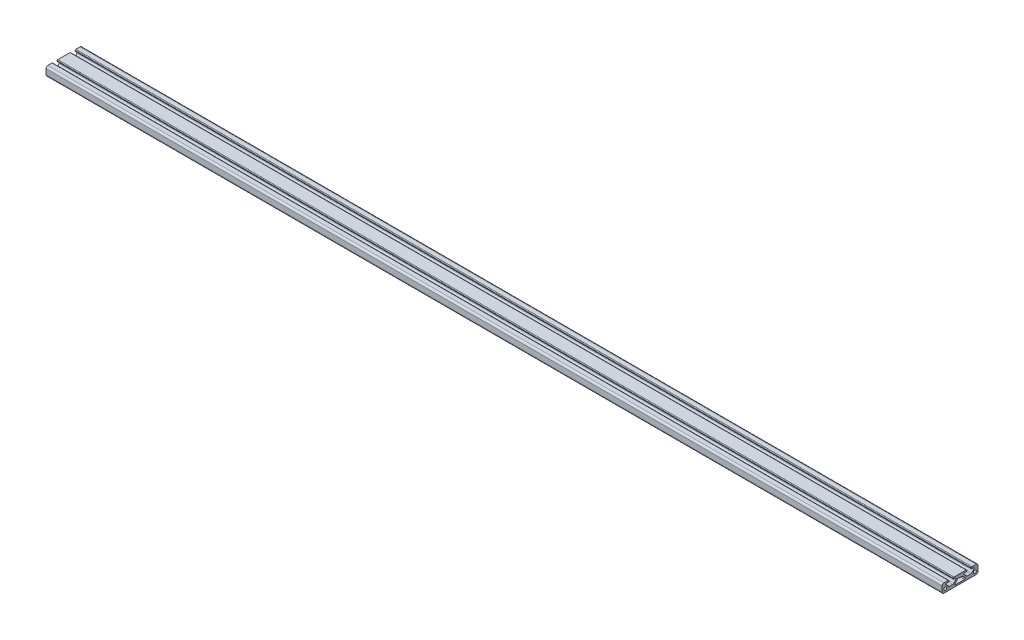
ISO-10303-21;
HEADER;
FILE_DESCRIPTION(('STEP AP214'),'2;1');
FILE_NAME('part.step','',(''),(''),'','','');
FILE_SCHEMA(('AUTOMOTIVE_DESIGN { 1 0 10303 214 1 1 1 1 }'));
ENDSEC;
DATA;
#1=APPLICATION_CONTEXT('core data for automotive mechanical design processes');
#2=APPLICATION_PROTOCOL_DEFINITION('international standard','automotive_design',2000,#1);
#3=PRODUCT_CONTEXT('',#1,'mechanical');
#4=PRODUCT('Part','Part','',(#3));
#5=PRODUCT_RELATED_PRODUCT_CATEGORY('part','',(#4));
#6=PRODUCT_DEFINITION_FORMATION('','',#4);
#7=PRODUCT_DEFINITION_CONTEXT('part definition',#1,'design');
#8=PRODUCT_DEFINITION('design','',#6,#7);
#9=PRODUCT_DEFINITION_SHAPE('','',#8);
#10=(LENGTH_UNIT() NAMED_UNIT(*) SI_UNIT(.MILLI.,.METRE.));
#11=(NAMED_UNIT(*) PLANE_ANGLE_UNIT() SI_UNIT($,.RADIAN.));
#12=(NAMED_UNIT(*) SI_UNIT($,.STERADIAN.) SOLID_ANGLE_UNIT());
#13=UNCERTAINTY_MEASURE_WITH_UNIT(LENGTH_MEASURE(1.E-05),#10,'distance_accuracy_value','');
#14=(GEOMETRIC_REPRESENTATION_CONTEXT(3) GLOBAL_UNCERTAINTY_ASSIGNED_CONTEXT((#13)) GLOBAL_UNIT_ASSIGNED_CONTEXT((#10,
#11,#12)) REPRESENTATION_CONTEXT('',''));
#15=CARTESIAN_POINT('',(0.,0.,0.));
#16=DIRECTION('',(0.,0.,1.));
#17=DIRECTION('',(1.,0.,0.));
#18=AXIS2_PLACEMENT_3D('',#15,#16,#17);
#19=CARTESIAN_POINT('',(1000.,3.7,-7.));
#20=DIRECTION('',(-1.,0.,0.));
#21=DIRECTION('',(0.,0.,1.));
#22=AXIS2_PLACEMENT_3D('',#19,#20,#21);
#23=CYLINDRICAL_SURFACE('',#22,0.5);
#24=CARTESIAN_POINT('',(0.,3.7,-7.));
#25=DIRECTION('',(1.,0.,0.));
#26=DIRECTION('',(0.,0.,-1.));
#27=AXIS2_PLACEMENT_3D('',#24,#25,#26);
#28=CIRCLE('',#27,0.5);
#29=CARTESIAN_POINT('',(0.,3.2,-7.));
#30=VERTEX_POINT('',#29);
#31=CARTESIAN_POINT('',(0.,3.7,-7.5));
#32=VERTEX_POINT('',#31);
#33=EDGE_CURVE('E586',#30,#32,#28,.T.);
#34=ORIENTED_EDGE('',*,*,#33,.T.);
#35=DIRECTION('',(-1.,0.,0.));
#36=VECTOR('',#35,1.);
#37=CARTESIAN_POINT('',(1000.,3.7,-7.5));
#38=LINE('',#37,#36);
#39=CARTESIAN_POINT('',(1000.,3.7,-7.5));
#40=VERTEX_POINT('',#39);
#41=EDGE_CURVE('E13',#40,#32,#38,.T.);
#42=ORIENTED_EDGE('',*,*,#41,.F.);
#43=CARTESIAN_POINT('',(1000.,3.7,-7.));
#44=DIRECTION('',(1.,0.,0.));
#45=DIRECTION('',(0.,0.,-1.));
#46=AXIS2_PLACEMENT_3D('',#43,#44,#45);
#47=CIRCLE('',#46,0.5);
#48=CARTESIAN_POINT('',(1000.,3.2,-7.));
#49=VERTEX_POINT('',#48);
#50=EDGE_CURVE('E855',#49,#40,#47,.T.);
#51=ORIENTED_EDGE('',*,*,#50,.F.);
#52=DIRECTION('',(-1.,0.,0.));
#53=VECTOR('',#52,1.);
#54=CARTESIAN_POINT('',(1000.,3.2,-7.));
#55=LINE('',#54,#53);
#56=EDGE_CURVE('E673',#49,#30,#55,.T.);
#57=ORIENTED_EDGE('',*,*,#56,.T.);
#58=EDGE_LOOP('',(#34,#42,#51,#57));
#59=FACE_BOUND('',#58,.T.);
#60=ADVANCED_FACE('F174',(#59),#23,.T.);
#61=CARTESIAN_POINT('',(1000.,4.25,-7.5));
#62=DIRECTION('',(0.,0.,1.));
#63=DIRECTION('',(1.,0.,0.));
#64=AXIS2_PLACEMENT_3D('',#61,#62,#63);
#65=PLANE('',#64);
#66=DIRECTION('',(0.,1.,0.));
#67=VECTOR('',#66,1.);
#68=CARTESIAN_POINT('',(0.,4.25,-7.5));
#69=LINE('',#68,#67);
#70=CARTESIAN_POINT('',(0.,4.25,-7.5));
#71=VERTEX_POINT('',#70);
#72=EDGE_CURVE('E589',#32,#71,#69,.T.);
#73=ORIENTED_EDGE('',*,*,#72,.T.);
#74=DIRECTION('',(-1.,0.,0.));
#75=VECTOR('',#74,1.);
#76=CARTESIAN_POINT('',(1000.,4.25,-7.5));
#77=LINE('',#76,#75);
#78=CARTESIAN_POINT('',(1000.,4.25,-7.5));
#79=VERTEX_POINT('',#78);
#80=EDGE_CURVE('E184',#79,#71,#77,.T.);
#81=ORIENTED_EDGE('',*,*,#80,.F.);
#82=DIRECTION('',(0.,1.,0.));
#83=VECTOR('',#82,1.);
#84=CARTESIAN_POINT('',(1000.,4.25,-7.5));
#85=LINE('',#84,#83);
#86=EDGE_CURVE('E857',#40,#79,#85,.T.);
#87=ORIENTED_EDGE('',*,*,#86,.F.);
#88=ORIENTED_EDGE('',*,*,#41,.T.);
#89=EDGE_LOOP('',(#73,#81,#87,#88));
#90=FACE_BOUND('',#89,.T.);
#91=ADVANCED_FACE('F963',(#90),#65,.F.);
#92=CARTESIAN_POINT('',(1000.,4.25,-6.75));
#93=DIRECTION('',(-1.,0.,0.));
#94=DIRECTION('',(0.,0.,1.));
#95=AXIS2_PLACEMENT_3D('',#92,#93,#94);
#96=CYLINDRICAL_SURFACE('',#95,0.75);
#97=CARTESIAN_POINT('',(0.,4.25,-6.75));
#98=DIRECTION('',(1.,0.,0.));
#99=DIRECTION('',(0.,0.,-1.));
#100=AXIS2_PLACEMENT_3D('',#97,#98,#99);
#101=CIRCLE('',#100,0.75);
#102=CARTESIAN_POINT('',(0.,5.,-6.75));
#103=VERTEX_POINT('',#102);
#104=EDGE_CURVE('E591',#71,#103,#101,.T.);
#105=ORIENTED_EDGE('',*,*,#104,.T.);
#106=DIRECTION('',(-1.,0.,0.));
#107=VECTOR('',#106,1.);
#108=CARTESIAN_POINT('',(1000.,5.,-6.75));
#109=LINE('',#108,#107);
#110=CARTESIAN_POINT('',(1000.,5.,-6.75));
#111=VERTEX_POINT('',#110);
#112=EDGE_CURVE('E788',#111,#103,#109,.T.);
#113=ORIENTED_EDGE('',*,*,#112,.F.);
#114=CARTESIAN_POINT('',(1000.,4.25,-6.75));
#115=DIRECTION('',(1.,0.,0.));
#116=DIRECTION('',(0.,0.,-1.));
#117=AXIS2_PLACEMENT_3D('',#114,#115,#116);
#118=CIRCLE('',#117,0.75);
#119=EDGE_CURVE('E859',#79,#111,#118,.T.);
#120=ORIENTED_EDGE('',*,*,#119,.F.);
#121=ORIENTED_EDGE('',*,*,#80,.T.);
#122=EDGE_LOOP('',(#105,#113,#120,#121));
#123=FACE_BOUND('',#122,.T.);
#124=ADVANCED_FACE('F968',(#123),#96,.T.);
#125=CARTESIAN_POINT('',(1000.,5.,6.75));
#126=DIRECTION('',(0.,-1.,0.));
#127=DIRECTION('',(0.,0.,-1.));
#128=AXIS2_PLACEMENT_3D('',#125,#126,#127);
#129=PLANE('',#128);
#130=DIRECTION('',(0.,0.,1.));
#131=VECTOR('',#130,1.);
#132=CARTESIAN_POINT('',(0.,5.,6.75));
#133=LINE('',#132,#131);
#134=CARTESIAN_POINT('',(0.,5.,6.75));
#135=VERTEX_POINT('',#134);
#136=EDGE_CURVE('E593',#103,#135,#133,.T.);
#137=ORIENTED_EDGE('',*,*,#136,.T.);
#138=DIRECTION('',(-1.,0.,0.));
#139=VECTOR('',#138,1.);
#140=CARTESIAN_POINT('',(1000.,5.,6.75));
#141=LINE('',#140,#139);
#142=CARTESIAN_POINT('',(1000.,5.,6.75));
#143=VERTEX_POINT('',#142);
#144=EDGE_CURVE('E785',#143,#135,#141,.T.);
#145=ORIENTED_EDGE('',*,*,#144,.F.);
#146=DIRECTION('',(0.,0.,1.));
#147=VECTOR('',#146,1.);
#148=CARTESIAN_POINT('',(1000.,5.,6.75));
#149=LINE('',#148,#147);
#150=EDGE_CURVE('E861',#111,#143,#149,.T.);
#151=ORIENTED_EDGE('',*,*,#150,.F.);
#152=ORIENTED_EDGE('',*,*,#112,.T.);
#153=EDGE_LOOP('',(#137,#145,#151,#152));
#154=FACE_BOUND('',#153,.T.);
#155=ADVANCED_FACE('F1531',(#154),#129,.F.);
#156=CARTESIAN_POINT('',(1000.,4.25,6.75));
#157=DIRECTION('',(-1.,0.,0.));
#158=DIRECTION('',(0.,0.,1.));
#159=AXIS2_PLACEMENT_3D('',#156,#157,#158);
#160=CYLINDRICAL_SURFACE('',#159,0.75);
#161=CARTESIAN_POINT('',(0.,4.25,6.75));
#162=DIRECTION('',(1.,0.,0.));
#163=DIRECTION('',(0.,0.,-1.));
#164=AXIS2_PLACEMENT_3D('',#161,#162,#163);
#165=CIRCLE('',#164,0.75);
#166=CARTESIAN_POINT('',(0.,4.25,7.5));
#167=VERTEX_POINT('',#166);
#168=EDGE_CURVE('E595',#135,#167,#165,.T.);
#169=ORIENTED_EDGE('',*,*,#168,.T.);
#170=DIRECTION('',(-1.,0.,0.));
#171=VECTOR('',#170,1.);
#172=CARTESIAN_POINT('',(1000.,4.25,7.5));
#173=LINE('',#172,#171);
#174=CARTESIAN_POINT('',(1000.,4.25,7.5));
#175=VERTEX_POINT('',#174);
#176=EDGE_CURVE('E782',#175,#167,#173,.T.);
#177=ORIENTED_EDGE('',*,*,#176,.F.);
#178=CARTESIAN_POINT('',(1000.,4.25,6.75));
#179=DIRECTION('',(1.,0.,0.));
#180=DIRECTION('',(0.,0.,-1.));
#181=AXIS2_PLACEMENT_3D('',#178,#179,#180);
#182=CIRCLE('',#181,0.75);
#183=EDGE_CURVE('E863',#143,#175,#182,.T.);
#184=ORIENTED_EDGE('',*,*,#183,.F.);
#185=ORIENTED_EDGE('',*,*,#144,.T.);
#186=EDGE_LOOP('',(#169,#177,#184,#185));
#187=FACE_BOUND('',#186,.T.);
#188=ADVANCED_FACE('F1520',(#187),#160,.T.);
#189=CARTESIAN_POINT('',(1000.,3.7,7.5));
#190=DIRECTION('',(0.,0.,-1.));
#191=DIRECTION('',(-1.,0.,0.));
#192=AXIS2_PLACEMENT_3D('',#189,#190,#191);
#193=PLANE('',#192);
#194=DIRECTION('',(0.,-1.,0.));
#195=VECTOR('',#194,1.);
#196=CARTESIAN_POINT('',(0.,3.7,7.5));
#197=LINE('',#196,#195);
#198=CARTESIAN_POINT('',(0.,3.7,7.5));
#199=VERTEX_POINT('',#198);
#200=EDGE_CURVE('E597',#167,#199,#197,.T.);
#201=ORIENTED_EDGE('',*,*,#200,.T.);
#202=DIRECTION('',(-1.,0.,0.));
#203=VECTOR('',#202,1.);
#204=CARTESIAN_POINT('',(1000.,3.7,7.5));
#205=LINE('',#204,#203);
#206=CARTESIAN_POINT('',(1000.,3.7,7.5));
#207=VERTEX_POINT('',#206);
#208=EDGE_CURVE('E779',#207,#199,#205,.T.);
#209=ORIENTED_EDGE('',*,*,#208,.F.);
#210=DIRECTION('',(0.,-1.,0.));
#211=VECTOR('',#210,1.);
#212=CARTESIAN_POINT('',(1000.,3.7,7.5));
#213=LINE('',#212,#211);
#214=EDGE_CURVE('E865',#175,#207,#213,.T.);
#215=ORIENTED_EDGE('',*,*,#214,.F.);
#216=ORIENTED_EDGE('',*,*,#176,.T.);
#217=EDGE_LOOP('',(#201,#209,#215,#216));
#218=FACE_BOUND('',#217,.T.);
#219=ADVANCED_FACE('F1509',(#218),#193,.F.);
#220=CARTESIAN_POINT('',(1000.,3.7,7.));
#221=DIRECTION('',(-1.,0.,0.));
#222=DIRECTION('',(0.,0.,1.));
#223=AXIS2_PLACEMENT_3D('',#220,#221,#222);
#224=CYLINDRICAL_SURFACE('',#223,0.5);
#225=CARTESIAN_POINT('',(0.,3.7,7.));
#226=DIRECTION('',(1.,0.,0.));
#227=DIRECTION('',(0.,0.,-1.));
#228=AXIS2_PLACEMENT_3D('',#225,#226,#227);
#229=CIRCLE('',#228,0.5);
#230=CARTESIAN_POINT('',(0.,3.2,7.));
#231=VERTEX_POINT('',#230);
#232=EDGE_CURVE('E599',#199,#231,#229,.T.);
#233=ORIENTED_EDGE('',*,*,#232,.T.);
#234=DIRECTION('',(-1.,0.,0.));
#235=VECTOR('',#234,1.);
#236=CARTESIAN_POINT('',(1000.,3.2,7.));
#237=LINE('',#236,#235);
#238=CARTESIAN_POINT('',(1000.,3.2,7.));
#239=VERTEX_POINT('',#238);
#240=EDGE_CURVE('E776',#239,#231,#237,.T.);
#241=ORIENTED_EDGE('',*,*,#240,.F.);
#242=CARTESIAN_POINT('',(1000.,3.7,7.));
#243=DIRECTION('',(1.,0.,0.));
#244=DIRECTION('',(0.,0.,-1.));
#245=AXIS2_PLACEMENT_3D('',#242,#243,#244);
#246=CIRCLE('',#245,0.5);
#247=EDGE_CURVE('E867',#207,#239,#246,.T.);
#248=ORIENTED_EDGE('',*,*,#247,.F.);
#249=ORIENTED_EDGE('',*,*,#208,.T.);
#250=EDGE_LOOP('',(#233,#241,#248,#249));
#251=FACE_BOUND('',#250,.T.);
#252=ADVANCED_FACE('F1498',(#251),#224,.T.);
#253=CARTESIAN_POINT('',(1000.,3.2,4.98994661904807));
#254=DIRECTION('',(0.,1.,0.));
#255=DIRECTION('',(0.,0.,1.));
#256=AXIS2_PLACEMENT_3D('',#253,#254,#255);
#257=PLANE('',#256);
#258=DIRECTION('',(0.,0.,-1.));
#259=VECTOR('',#258,1.);
#260=CARTESIAN_POINT('',(0.,3.2,4.98994661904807));
#261=LINE('',#260,#259);
#262=CARTESIAN_POINT('',(0.,3.2,4.98994661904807));
#263=VERTEX_POINT('',#262);
#264=EDGE_CURVE('E601',#231,#263,#261,.T.);
#265=ORIENTED_EDGE('',*,*,#264,.T.);
#266=DIRECTION('',(-1.,0.,0.));
#267=VECTOR('',#266,1.);
#268=CARTESIAN_POINT('',(1000.,3.2,4.98994661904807));
#269=LINE('',#268,#267);
#270=CARTESIAN_POINT('',(1000.,3.2,4.98994661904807));
#271=VERTEX_POINT('',#270);
#272=EDGE_CURVE('E773',#271,#263,#269,.T.);
#273=ORIENTED_EDGE('',*,*,#272,.F.);
#274=DIRECTION('',(0.,0.,-1.));
#275=VECTOR('',#274,1.);
#276=CARTESIAN_POINT('',(1000.,3.2,4.98994661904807));
#277=LINE('',#276,#275);
#278=EDGE_CURVE('E869',#239,#271,#277,.T.);
#279=ORIENTED_EDGE('',*,*,#278,.F.);
#280=ORIENTED_EDGE('',*,*,#240,.T.);
#281=EDGE_LOOP('',(#265,#273,#279,#280));
#282=FACE_BOUND('',#281,.T.);
#283=ADVANCED_FACE('F1487',(#282),#257,.F.);
#284=CARTESIAN_POINT('',(1000.,2.46005338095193,4.98994661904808));
#285=DIRECTION('',(-1.,0.,0.));
#286=DIRECTION('',(0.,0.,1.));
#287=AXIS2_PLACEMENT_3D('',#284,#285,#286);
#288=CYLINDRICAL_SURFACE('',#287,0.739946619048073);
#289=CARTESIAN_POINT('',(0.,2.46005338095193,4.98994661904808));
#290=DIRECTION('',(-1.,0.,0.));
#291=DIRECTION('',(0.,0.,-1.));
#292=AXIS2_PLACEMENT_3D('',#289,#290,#291);
#293=CIRCLE('',#292,0.739946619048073);
#294=CARTESIAN_POINT('',(0.,2.06533965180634,4.36406957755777));
#295=VERTEX_POINT('',#294);
#296=EDGE_CURVE('E603',#263,#295,#293,.T.);
#297=ORIENTED_EDGE('',*,*,#296,.T.);
#298=DIRECTION('',(-1.,0.,0.));
#299=VECTOR('',#298,1.);
#300=CARTESIAN_POINT('',(1000.,2.06533965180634,4.36406957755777));
#301=LINE('',#300,#299);
#302=CARTESIAN_POINT('',(1000.,2.06533965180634,4.36406957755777));
#303=VERTEX_POINT('',#302);
#304=EDGE_CURVE('E770',#303,#295,#301,.T.);
#305=ORIENTED_EDGE('',*,*,#304,.F.);
#306=CARTESIAN_POINT('',(1000.,2.46005338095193,4.98994661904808));
#307=DIRECTION('',(-1.,0.,0.));
#308=DIRECTION('',(0.,0.,-1.));
#309=AXIS2_PLACEMENT_3D('',#306,#307,#308);
#310=CIRCLE('',#309,0.739946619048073);
#311=EDGE_CURVE('E871',#271,#303,#310,.T.);
#312=ORIENTED_EDGE('',*,*,#311,.F.);
#313=ORIENTED_EDGE('',*,*,#272,.T.);
#314=EDGE_LOOP('',(#297,#305,#312,#313));
#315=FACE_BOUND('',#314,.T.);
#316=ADVANCED_FACE('F1476',(#315),#288,.F.);
#317=CARTESIAN_POINT('',(1000.,2.06533965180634,4.36406957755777));
#318=DIRECTION('',(0.,-0.595165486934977,-0.803603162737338));
#319=DIRECTION('',(0.,0.803603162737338,-0.595165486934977));
#320=AXIS2_PLACEMENT_3D('',#317,#318,#319);
#321=PLANE('',#320);
#322=DIRECTION('',(0.,-0.803603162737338,0.595165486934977));
#323=VECTOR('',#322,1.);
#324=CARTESIAN_POINT('',(0.,2.06533965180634,4.36406957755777));
#325=LINE('',#324,#323);
#326=CARTESIAN_POINT('',(0.,0.503644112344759,5.52069430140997));
#327=VERTEX_POINT('',#326);
#328=EDGE_CURVE('E605',#295,#327,#325,.T.);
#329=ORIENTED_EDGE('',*,*,#328,.T.);
#330=DIRECTION('',(-1.,0.,0.));
#331=VECTOR('',#330,1.);
#332=CARTESIAN_POINT('',(1000.,0.503644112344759,5.52069430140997));
#333=LINE('',#332,#331);
#334=CARTESIAN_POINT('',(1000.,0.503644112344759,5.52069430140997));
#335=VERTEX_POINT('',#334);
#336=EDGE_CURVE('E767',#335,#327,#333,.T.);
#337=ORIENTED_EDGE('',*,*,#336,.F.);
#338=DIRECTION('',(0.,-0.803603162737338,0.595165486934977));
#339=VECTOR('',#338,1.);
#340=CARTESIAN_POINT('',(1000.,2.06533965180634,4.36406957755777));
#341=LINE('',#340,#339);
#342=EDGE_CURVE('E873',#303,#335,#341,.T.);
#343=ORIENTED_EDGE('',*,*,#342,.F.);
#344=ORIENTED_EDGE('',*,*,#304,.T.);
#345=EDGE_LOOP('',(#329,#337,#343,#344));
#346=FACE_BOUND('',#345,.T.);
#347=ADVANCED_FACE('F1465',(#346),#321,.F.);
#348=CARTESIAN_POINT('',(1000.,0.503644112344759,5.52069430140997));
#349=DIRECTION('',(0.,-0.708309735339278,-0.705901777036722));
#350=DIRECTION('',(0.,0.705901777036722,-0.708309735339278));
#351=AXIS2_PLACEMENT_3D('',#348,#349,#350);
#352=PLANE('',#351);
#353=DIRECTION('',(0.,-0.705901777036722,0.708309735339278));
#354=VECTOR('',#353,1.);
#355=CARTESIAN_POINT('',(0.,0.503644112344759,5.52069430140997));
#356=LINE('',#355,#354);
#357=CARTESIAN_POINT('',(0.,-0.868181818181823,6.89719977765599));
#358=VERTEX_POINT('',#357);
#359=EDGE_CURVE('E607',#327,#358,#356,.T.);
#360=ORIENTED_EDGE('',*,*,#359,.T.);
#361=DIRECTION('',(-1.,0.,0.));
#362=VECTOR('',#361,1.);
#363=CARTESIAN_POINT('',(1000.,-0.868181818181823,6.89719977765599));
#364=LINE('',#363,#362);
#365=CARTESIAN_POINT('',(1000.,-0.868181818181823,6.89719977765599));
#366=VERTEX_POINT('',#365);
#367=EDGE_CURVE('E764',#366,#358,#364,.T.);
#368=ORIENTED_EDGE('',*,*,#367,.F.);
#369=DIRECTION('',(0.,-0.705901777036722,0.708309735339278));
#370=VECTOR('',#369,1.);
#371=CARTESIAN_POINT('',(1000.,0.503644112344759,5.52069430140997));
#372=LINE('',#371,#370);
#373=EDGE_CURVE('E875',#335,#366,#372,.T.);
#374=ORIENTED_EDGE('',*,*,#373,.F.);
#375=ORIENTED_EDGE('',*,*,#336,.T.);
#376=EDGE_LOOP('',(#360,#368,#374,#375));
#377=FACE_BOUND('',#376,.T.);
#378=ADVANCED_FACE('F1454',(#377),#352,.F.);
#379=CARTESIAN_POINT('',(1000.,0.649999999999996,8.19916904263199));
#380=DIRECTION('',(-1.,0.,0.));
#381=DIRECTION('',(0.,0.,1.));
#382=AXIS2_PLACEMENT_3D('',#379,#380,#381);
#383=CYLINDRICAL_SURFACE('',#382,2.);
#384=CARTESIAN_POINT('',(0.,0.649999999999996,8.19916904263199));
#385=DIRECTION('',(-1.,0.,0.));
#386=DIRECTION('',(0.,0.,-1.));
#387=AXIS2_PLACEMENT_3D('',#384,#385,#386);
#388=CIRCLE('',#387,2.);
#389=CARTESIAN_POINT('',(0.,-1.35,8.19916904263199));
#390=VERTEX_POINT('',#389);
#391=EDGE_CURVE('E609',#358,#390,#388,.T.);
#392=ORIENTED_EDGE('',*,*,#391,.T.);
#393=DIRECTION('',(-1.,0.,0.));
#394=VECTOR('',#393,1.);
#395=CARTESIAN_POINT('',(1000.,-1.35,8.19916904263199));
#396=LINE('',#395,#394);
#397=CARTESIAN_POINT('',(1000.,-1.35,8.19916904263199));
#398=VERTEX_POINT('',#397);
#399=EDGE_CURVE('E761',#398,#390,#396,.T.);
#400=ORIENTED_EDGE('',*,*,#399,.F.);
#401=CARTESIAN_POINT('',(1000.,0.649999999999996,8.19916904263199));
#402=DIRECTION('',(-1.,0.,0.));
#403=DIRECTION('',(0.,0.,-1.));
#404=AXIS2_PLACEMENT_3D('',#401,#402,#403);
#405=CIRCLE('',#404,2.);
#406=EDGE_CURVE('E877',#366,#398,#405,.T.);
#407=ORIENTED_EDGE('',*,*,#406,.F.);
#408=ORIENTED_EDGE('',*,*,#367,.T.);
#409=EDGE_LOOP('',(#392,#400,#407,#408));
#410=FACE_BOUND('',#409,.T.);
#411=ADVANCED_FACE('F1443',(#410),#383,.F.);
#412=CARTESIAN_POINT('',(1000.,-1.35,11.800830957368));
#413=DIRECTION('',(0.,-1.,0.));
#414=DIRECTION('',(0.,0.,-1.));
#415=AXIS2_PLACEMENT_3D('',#412,#413,#414);
#416=PLANE('',#415);
#417=DIRECTION('',(0.,0.,1.));
#418=VECTOR('',#417,1.);
#419=CARTESIAN_POINT('',(0.,-1.35,11.800830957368));
#420=LINE('',#419,#418);
#421=CARTESIAN_POINT('',(0.,-1.35,11.800830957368));
#422=VERTEX_POINT('',#421);
#423=EDGE_CURVE('E611',#390,#422,#420,.T.);
#424=ORIENTED_EDGE('',*,*,#423,.T.);
#425=DIRECTION('',(-1.,0.,0.));
#426=VECTOR('',#425,1.);
#427=CARTESIAN_POINT('',(1000.,-1.35,11.800830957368));
#428=LINE('',#427,#426);
#429=CARTESIAN_POINT('',(1000.,-1.35,11.800830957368));
#430=VERTEX_POINT('',#429);
#431=EDGE_CURVE('E758',#430,#422,#428,.T.);
#432=ORIENTED_EDGE('',*,*,#431,.F.);
#433=DIRECTION('',(0.,0.,1.));
#434=VECTOR('',#433,1.);
#435=CARTESIAN_POINT('',(1000.,-1.35,11.800830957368));
#436=LINE('',#435,#434);
#437=EDGE_CURVE('E879',#398,#430,#436,.T.);
#438=ORIENTED_EDGE('',*,*,#437,.F.);
#439=ORIENTED_EDGE('',*,*,#399,.T.);
#440=EDGE_LOOP('',(#424,#432,#438,#439));
#441=FACE_BOUND('',#440,.T.);
#442=ADVANCED_FACE('F1432',(#441),#416,.F.);
#443=CARTESIAN_POINT('',(1000.,0.650000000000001,11.800830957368));
#444=DIRECTION('',(-1.,0.,0.));
#445=DIRECTION('',(0.,0.,1.));
#446=AXIS2_PLACEMENT_3D('',#443,#444,#445);
#447=CYLINDRICAL_SURFACE('',#446,2.);
#448=CARTESIAN_POINT('',(0.,0.650000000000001,11.800830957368));
#449=DIRECTION('',(-1.,0.,0.));
#450=DIRECTION('',(0.,0.,-1.));
#451=AXIS2_PLACEMENT_3D('',#448,#449,#450);
#452=CIRCLE('',#451,2.);
#453=CARTESIAN_POINT('',(0.,-0.868181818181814,13.102800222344));
#454=VERTEX_POINT('',#453);
#455=EDGE_CURVE('E613',#422,#454,#452,.T.);
#456=ORIENTED_EDGE('',*,*,#455,.T.);
#457=DIRECTION('',(-1.,0.,0.));
#458=VECTOR('',#457,1.);
#459=CARTESIAN_POINT('',(1000.,-0.868181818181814,13.102800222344));
#460=LINE('',#459,#458);
#461=CARTESIAN_POINT('',(1000.,-0.868181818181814,13.102800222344));
#462=VERTEX_POINT('',#461);
#463=EDGE_CURVE('E755',#462,#454,#460,.T.);
#464=ORIENTED_EDGE('',*,*,#463,.F.);
#465=CARTESIAN_POINT('',(1000.,0.650000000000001,11.800830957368));
#466=DIRECTION('',(-1.,0.,0.));
#467=DIRECTION('',(0.,0.,-1.));
#468=AXIS2_PLACEMENT_3D('',#465,#466,#467);
#469=CIRCLE('',#468,2.);
#470=EDGE_CURVE('E881',#430,#462,#469,.T.);
#471=ORIENTED_EDGE('',*,*,#470,.F.);
#472=ORIENTED_EDGE('',*,*,#431,.T.);
#473=EDGE_LOOP('',(#456,#464,#471,#472));
#474=FACE_BOUND('',#473,.T.);
#475=ADVANCED_FACE('F1421',(#474),#447,.F.);
#476=CARTESIAN_POINT('',(1000.,-0.868181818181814,13.102800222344));
#477=DIRECTION('',(0.,-0.708309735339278,0.705901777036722));
#478=DIRECTION('',(0.,-0.705901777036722,-0.708309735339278));
#479=AXIS2_PLACEMENT_3D('',#476,#477,#478);
#480=PLANE('',#479);
#481=DIRECTION('',(0.,0.705901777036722,0.708309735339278));
#482=VECTOR('',#481,1.);
#483=CARTESIAN_POINT('',(0.,-0.868181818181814,13.102800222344));
#484=LINE('',#483,#482);
#485=CARTESIAN_POINT('',(0.,0.503644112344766,14.47930569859));
#486=VERTEX_POINT('',#485);
#487=EDGE_CURVE('E615',#454,#486,#484,.T.);
#488=ORIENTED_EDGE('',*,*,#487,.T.);
#489=DIRECTION('',(-1.,0.,0.));
#490=VECTOR('',#489,1.);
#491=CARTESIAN_POINT('',(1000.,0.503644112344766,14.47930569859));
#492=LINE('',#491,#490);
#493=CARTESIAN_POINT('',(1000.,0.503644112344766,14.47930569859));
#494=VERTEX_POINT('',#493);
#495=EDGE_CURVE('E752',#494,#486,#492,.T.);
#496=ORIENTED_EDGE('',*,*,#495,.F.);
#497=DIRECTION('',(0.,0.705901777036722,0.708309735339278));
#498=VECTOR('',#497,1.);
#499=CARTESIAN_POINT('',(1000.,-0.868181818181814,13.102800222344));
#500=LINE('',#499,#498);
#501=EDGE_CURVE('E883',#462,#494,#500,.T.);
#502=ORIENTED_EDGE('',*,*,#501,.F.);
#503=ORIENTED_EDGE('',*,*,#463,.T.);
#504=EDGE_LOOP('',(#488,#496,#502,#503));
#505=FACE_BOUND('',#504,.T.);
#506=ADVANCED_FACE('F1410',(#505),#480,.F.);
#507=CARTESIAN_POINT('',(1000.,0.503644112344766,14.47930569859));
#508=DIRECTION('',(0.,-0.595165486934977,0.803603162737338));
#509=DIRECTION('',(0.,-0.803603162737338,-0.595165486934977));
#510=AXIS2_PLACEMENT_3D('',#507,#508,#509);
#511=PLANE('',#510);
#512=DIRECTION('',(0.,0.803603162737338,0.595165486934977));
#513=VECTOR('',#512,1.);
#514=CARTESIAN_POINT('',(0.,0.503644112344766,14.47930569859));
#515=LINE('',#514,#513);
#516=CARTESIAN_POINT('',(0.,2.06533965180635,15.6359304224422));
#517=VERTEX_POINT('',#516);
#518=EDGE_CURVE('E617',#486,#517,#515,.T.);
#519=ORIENTED_EDGE('',*,*,#518,.T.);
#520=DIRECTION('',(-1.,0.,0.));
#521=VECTOR('',#520,1.);
#522=CARTESIAN_POINT('',(1000.,2.06533965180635,15.6359304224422));
#523=LINE('',#522,#521);
#524=CARTESIAN_POINT('',(1000.,2.06533965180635,15.6359304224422));
#525=VERTEX_POINT('',#524);
#526=EDGE_CURVE('E749',#525,#517,#523,.T.);
#527=ORIENTED_EDGE('',*,*,#526,.F.);
#528=DIRECTION('',(0.,0.803603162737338,0.595165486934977));
#529=VECTOR('',#528,1.);
#530=CARTESIAN_POINT('',(1000.,0.503644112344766,14.47930569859));
#531=LINE('',#530,#529);
#532=EDGE_CURVE('E885',#494,#525,#531,.T.);
#533=ORIENTED_EDGE('',*,*,#532,.F.);
#534=ORIENTED_EDGE('',*,*,#495,.T.);
#535=EDGE_LOOP('',(#519,#527,#533,#534));
#536=FACE_BOUND('',#535,.T.);
#537=ADVANCED_FACE('F1399',(#536),#511,.F.);
#538=CARTESIAN_POINT('',(1000.,2.46005338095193,15.0100533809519));
#539=DIRECTION('',(-1.,0.,0.));
#540=DIRECTION('',(0.,0.,1.));
#541=AXIS2_PLACEMENT_3D('',#538,#539,#540);
#542=CYLINDRICAL_SURFACE('',#541,0.739946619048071);
#543=CARTESIAN_POINT('',(0.,2.46005338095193,15.0100533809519));
#544=DIRECTION('',(-1.,0.,0.));
#545=DIRECTION('',(0.,0.,-1.));
#546=AXIS2_PLACEMENT_3D('',#543,#544,#545);
#547=CIRCLE('',#546,0.739946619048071);
#548=CARTESIAN_POINT('',(0.,3.2,15.0100533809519));
#549=VERTEX_POINT('',#548);
#550=EDGE_CURVE('E619',#517,#549,#547,.T.);
#551=ORIENTED_EDGE('',*,*,#550,.T.);
#552=DIRECTION('',(-1.,0.,0.));
#553=VECTOR('',#552,1.);
#554=CARTESIAN_POINT('',(1000.,3.2,15.0100533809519));
#555=LINE('',#554,#553);
#556=CARTESIAN_POINT('',(1000.,3.2,15.0100533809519));
#557=VERTEX_POINT('',#556);
#558=EDGE_CURVE('E746',#557,#549,#555,.T.);
#559=ORIENTED_EDGE('',*,*,#558,.F.);
#560=CARTESIAN_POINT('',(1000.,2.46005338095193,15.0100533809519));
#561=DIRECTION('',(-1.,0.,0.));
#562=DIRECTION('',(0.,0.,-1.));
#563=AXIS2_PLACEMENT_3D('',#560,#561,#562);
#564=CIRCLE('',#563,0.739946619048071);
#565=EDGE_CURVE('E887',#525,#557,#564,.T.);
#566=ORIENTED_EDGE('',*,*,#565,.F.);
#567=ORIENTED_EDGE('',*,*,#526,.T.);
#568=EDGE_LOOP('',(#551,#559,#566,#567));
#569=FACE_BOUND('',#568,.T.);
#570=ADVANCED_FACE('F1388',(#569),#542,.F.);
#571=CARTESIAN_POINT('',(1000.,3.2,13.));
#572=DIRECTION('',(0.,1.,0.));
#573=DIRECTION('',(0.,0.,1.));
#574=AXIS2_PLACEMENT_3D('',#571,#572,#573);
#575=PLANE('',#574);
#576=DIRECTION('',(0.,0.,-1.));
#577=VECTOR('',#576,1.);
#578=CARTESIAN_POINT('',(0.,3.2,13.));
#579=LINE('',#578,#577);
#580=CARTESIAN_POINT('',(0.,3.2,13.));
#581=VERTEX_POINT('',#580);
#582=EDGE_CURVE('E621',#549,#581,#579,.T.);
#583=ORIENTED_EDGE('',*,*,#582,.T.);
#584=DIRECTION('',(-1.,0.,0.));
#585=VECTOR('',#584,1.);
#586=CARTESIAN_POINT('',(1000.,3.2,13.));
#587=LINE('',#586,#585);
#588=CARTESIAN_POINT('',(1000.,3.2,13.));
#589=VERTEX_POINT('',#588);
#590=EDGE_CURVE('E743',#589,#581,#587,.T.);
#591=ORIENTED_EDGE('',*,*,#590,.F.);
#592=DIRECTION('',(0.,0.,-1.));
#593=VECTOR('',#592,1.);
#594=CARTESIAN_POINT('',(1000.,3.2,13.));
#595=LINE('',#594,#593);
#596=EDGE_CURVE('E889',#557,#589,#595,.T.);
#597=ORIENTED_EDGE('',*,*,#596,.F.);
#598=ORIENTED_EDGE('',*,*,#558,.T.);
#599=EDGE_LOOP('',(#583,#591,#597,#598));
#600=FACE_BOUND('',#599,.T.);
#601=ADVANCED_FACE('F1377',(#600),#575,.F.);
#602=CARTESIAN_POINT('',(1000.,3.7,13.));
#603=DIRECTION('',(-1.,0.,0.));
#604=DIRECTION('',(0.,0.,1.));
#605=AXIS2_PLACEMENT_3D('',#602,#603,#604);
#606=CYLINDRICAL_SURFACE('',#605,0.5);
#607=CARTESIAN_POINT('',(0.,3.7,13.));
#608=DIRECTION('',(1.,0.,0.));
#609=DIRECTION('',(0.,0.,-1.));
#610=AXIS2_PLACEMENT_3D('',#607,#608,#609);
#611=CIRCLE('',#610,0.5);
#612=CARTESIAN_POINT('',(0.,3.7,12.5));
#613=VERTEX_POINT('',#612);
#614=EDGE_CURVE('E623',#581,#613,#611,.T.);
#615=ORIENTED_EDGE('',*,*,#614,.T.);
#616=DIRECTION('',(-1.,0.,0.));
#617=VECTOR('',#616,1.);
#618=CARTESIAN_POINT('',(1000.,3.7,12.5));
#619=LINE('',#618,#617);
#620=CARTESIAN_POINT('',(1000.,3.7,12.5));
#621=VERTEX_POINT('',#620);
#622=EDGE_CURVE('E740',#621,#613,#619,.T.);
#623=ORIENTED_EDGE('',*,*,#622,.F.);
#624=CARTESIAN_POINT('',(1000.,3.7,13.));
#625=DIRECTION('',(1.,0.,0.));
#626=DIRECTION('',(0.,0.,-1.));
#627=AXIS2_PLACEMENT_3D('',#624,#625,#626);
#628=CIRCLE('',#627,0.5);
#629=EDGE_CURVE('E891',#589,#621,#628,.T.);
#630=ORIENTED_EDGE('',*,*,#629,.F.);
#631=ORIENTED_EDGE('',*,*,#590,.T.);
#632=EDGE_LOOP('',(#615,#623,#630,#631));
#633=FACE_BOUND('',#632,.T.);
#634=ADVANCED_FACE('F1366',(#633),#606,.T.);
#635=CARTESIAN_POINT('',(1000.,4.25,12.5));
#636=DIRECTION('',(0.,0.,1.));
#637=DIRECTION('',(1.,0.,0.));
#638=AXIS2_PLACEMENT_3D('',#635,#636,#637);
#639=PLANE('',#638);
#640=DIRECTION('',(0.,1.,0.));
#641=VECTOR('',#640,1.);
#642=CARTESIAN_POINT('',(0.,4.25,12.5));
#643=LINE('',#642,#641);
#644=CARTESIAN_POINT('',(0.,4.25,12.5));
#645=VERTEX_POINT('',#644);
#646=EDGE_CURVE('E625',#613,#645,#643,.T.);
#647=ORIENTED_EDGE('',*,*,#646,.T.);
#648=DIRECTION('',(-1.,0.,0.));
#649=VECTOR('',#648,1.);
#650=CARTESIAN_POINT('',(1000.,4.25,12.5));
#651=LINE('',#650,#649);
#652=CARTESIAN_POINT('',(1000.,4.25,12.5));
#653=VERTEX_POINT('',#652);
#654=EDGE_CURVE('E737',#653,#645,#651,.T.);
#655=ORIENTED_EDGE('',*,*,#654,.F.);
#656=DIRECTION('',(0.,1.,0.));
#657=VECTOR('',#656,1.);
#658=CARTESIAN_POINT('',(1000.,4.25,12.5));
#659=LINE('',#658,#657);
#660=EDGE_CURVE('E893',#621,#653,#659,.T.);
#661=ORIENTED_EDGE('',*,*,#660,.F.);
#662=ORIENTED_EDGE('',*,*,#622,.T.);
#663=EDGE_LOOP('',(#647,#655,#661,#662));
#664=FACE_BOUND('',#663,.T.);
#665=ADVANCED_FACE('F1355',(#664),#639,.F.);
#666=CARTESIAN_POINT('',(1000.,4.25,13.25));
#667=DIRECTION('',(-1.,0.,0.));
#668=DIRECTION('',(0.,0.,1.));
#669=AXIS2_PLACEMENT_3D('',#666,#667,#668);
#670=CYLINDRICAL_SURFACE('',#669,0.75);
#671=CARTESIAN_POINT('',(0.,4.25,13.25));
#672=DIRECTION('',(1.,0.,0.));
#673=DIRECTION('',(0.,0.,-1.));
#674=AXIS2_PLACEMENT_3D('',#671,#672,#673);
#675=CIRCLE('',#674,0.75);
#676=CARTESIAN_POINT('',(0.,5.,13.25));
#677=VERTEX_POINT('',#676);
#678=EDGE_CURVE('E627',#645,#677,#675,.T.);
#679=ORIENTED_EDGE('',*,*,#678,.T.);
#680=DIRECTION('',(-1.,0.,0.));
#681=VECTOR('',#680,1.);
#682=CARTESIAN_POINT('',(1000.,5.,13.25));
#683=LINE('',#682,#681);
#684=CARTESIAN_POINT('',(1000.,5.,13.25));
#685=VERTEX_POINT('',#684);
#686=EDGE_CURVE('E734',#685,#677,#683,.T.);
#687=ORIENTED_EDGE('',*,*,#686,.F.);
#688=CARTESIAN_POINT('',(1000.,4.25,13.25));
#689=DIRECTION('',(1.,0.,0.));
#690=DIRECTION('',(0.,0.,-1.));
#691=AXIS2_PLACEMENT_3D('',#688,#689,#690);
#692=CIRCLE('',#691,0.75);
#693=EDGE_CURVE('E895',#653,#685,#692,.T.);
#694=ORIENTED_EDGE('',*,*,#693,.F.);
#695=ORIENTED_EDGE('',*,*,#654,.T.);
#696=EDGE_LOOP('',(#679,#687,#694,#695));
#697=FACE_BOUND('',#696,.T.);
#698=ADVANCED_FACE('F1344',(#697),#670,.T.);
#699=CARTESIAN_POINT('',(1000.,5.,18.));
#700=DIRECTION('',(0.,-1.,0.));
#701=DIRECTION('',(0.,0.,-1.));
#702=AXIS2_PLACEMENT_3D('',#699,#700,#701);
#703=PLANE('',#702);
#704=DIRECTION('',(0.,0.,1.));
#705=VECTOR('',#704,1.);
#706=CARTESIAN_POINT('',(0.,5.,18.));
#707=LINE('',#706,#705);
#708=CARTESIAN_POINT('',(0.,5.,18.));
#709=VERTEX_POINT('',#708);
#710=EDGE_CURVE('E629',#677,#709,#707,.T.);
#711=ORIENTED_EDGE('',*,*,#710,.T.);
#712=DIRECTION('',(-1.,0.,0.));
#713=VECTOR('',#712,1.);
#714=CARTESIAN_POINT('',(1000.,5.,18.));
#715=LINE('',#714,#713);
#716=CARTESIAN_POINT('',(1000.,5.,18.));
#717=VERTEX_POINT('',#716);
#718=EDGE_CURVE('E731',#717,#709,#715,.T.);
#719=ORIENTED_EDGE('',*,*,#718,.F.);
#720=DIRECTION('',(0.,0.,1.));
#721=VECTOR('',#720,1.);
#722=CARTESIAN_POINT('',(1000.,5.,18.));
#723=LINE('',#722,#721);
#724=EDGE_CURVE('E897',#685,#717,#723,.T.);
#725=ORIENTED_EDGE('',*,*,#724,.F.);
#726=ORIENTED_EDGE('',*,*,#686,.T.);
#727=EDGE_LOOP('',(#711,#719,#725,#726));
#728=FACE_BOUND('',#727,.T.);
#729=ADVANCED_FACE('F1333',(#728),#703,.F.);
#730=CARTESIAN_POINT('',(1000.,3.,18.));
#731=DIRECTION('',(-1.,0.,0.));
#732=DIRECTION('',(0.,0.,1.));
#733=AXIS2_PLACEMENT_3D('',#730,#731,#732);
#734=CYLINDRICAL_SURFACE('',#733,2.);
#735=CARTESIAN_POINT('',(0.,3.,18.));
#736=DIRECTION('',(1.,0.,0.));
#737=DIRECTION('',(0.,0.,-1.));
#738=AXIS2_PLACEMENT_3D('',#735,#736,#737);
#739=CIRCLE('',#738,2.);
#740=CARTESIAN_POINT('',(0.,3.,20.));
#741=VERTEX_POINT('',#740);
#742=EDGE_CURVE('E631',#709,#741,#739,.T.);
#743=ORIENTED_EDGE('',*,*,#742,.T.);
#744=DIRECTION('',(-1.,0.,0.));
#745=VECTOR('',#744,1.);
#746=CARTESIAN_POINT('',(1000.,3.,20.));
#747=LINE('',#746,#745);
#748=CARTESIAN_POINT('',(1000.,3.,20.));
#749=VERTEX_POINT('',#748);
#750=EDGE_CURVE('E728',#749,#741,#747,.T.);
#751=ORIENTED_EDGE('',*,*,#750,.F.);
#752=CARTESIAN_POINT('',(1000.,3.,18.));
#753=DIRECTION('',(1.,0.,0.));
#754=DIRECTION('',(0.,0.,-1.));
#755=AXIS2_PLACEMENT_3D('',#752,#753,#754);
#756=CIRCLE('',#755,2.);
#757=EDGE_CURVE('E899',#717,#749,#756,.T.);
#758=ORIENTED_EDGE('',*,*,#757,.F.);
#759=ORIENTED_EDGE('',*,*,#718,.T.);
#760=EDGE_LOOP('',(#743,#751,#758,#759));
#761=FACE_BOUND('',#760,.T.);
#762=ADVANCED_FACE('F1322',(#761),#734,.T.);
#763=CARTESIAN_POINT('',(1000.,-3.,20.));
#764=DIRECTION('',(0.,0.,-1.));
#765=DIRECTION('',(-1.,0.,0.));
#766=AXIS2_PLACEMENT_3D('',#763,#764,#765);
#767=PLANE('',#766);
#768=DIRECTION('',(0.,-1.,0.));
#769=VECTOR('',#768,1.);
#770=CARTESIAN_POINT('',(0.,-3.,20.));
#771=LINE('',#770,#769);
#772=CARTESIAN_POINT('',(0.,-3.,20.));
#773=VERTEX_POINT('',#772);
#774=EDGE_CURVE('E633',#741,#773,#771,.T.);
#775=ORIENTED_EDGE('',*,*,#774,.T.);
#776=DIRECTION('',(-1.,0.,0.));
#777=VECTOR('',#776,1.);
#778=CARTESIAN_POINT('',(1000.,-3.,20.));
#779=LINE('',#778,#777);
#780=CARTESIAN_POINT('',(1000.,-3.,20.));
#781=VERTEX_POINT('',#780);
#782=EDGE_CURVE('E725',#781,#773,#779,.T.);
#783=ORIENTED_EDGE('',*,*,#782,.F.);
#784=DIRECTION('',(0.,-1.,0.));
#785=VECTOR('',#784,1.);
#786=CARTESIAN_POINT('',(1000.,-3.,20.));
#787=LINE('',#786,#785);
#788=EDGE_CURVE('E901',#749,#781,#787,.T.);
#789=ORIENTED_EDGE('',*,*,#788,.F.);
#790=ORIENTED_EDGE('',*,*,#750,.T.);
#791=EDGE_LOOP('',(#775,#783,#789,#790));
#792=FACE_BOUND('',#791,.T.);
#793=ADVANCED_FACE('F1311',(#792),#767,.F.);
#794=CARTESIAN_POINT('',(1000.,-3.,18.));
#795=DIRECTION('',(-1.,0.,0.));
#796=DIRECTION('',(0.,0.,1.));
#797=AXIS2_PLACEMENT_3D('',#794,#795,#796);
#798=CYLINDRICAL_SURFACE('',#797,2.);
#799=CARTESIAN_POINT('',(0.,-3.,18.));
#800=DIRECTION('',(1.,0.,0.));
#801=DIRECTION('',(0.,0.,-1.));
#802=AXIS2_PLACEMENT_3D('',#799,#800,#801);
#803=CIRCLE('',#802,2.);
#804=CARTESIAN_POINT('',(0.,-5.,18.));
#805=VERTEX_POINT('',#804);
#806=EDGE_CURVE('E635',#773,#805,#803,.T.);
#807=ORIENTED_EDGE('',*,*,#806,.T.);
#808=DIRECTION('',(-1.,0.,0.));
#809=VECTOR('',#808,1.);
#810=CARTESIAN_POINT('',(1000.,-5.,18.));
#811=LINE('',#810,#809);
#812=CARTESIAN_POINT('',(1000.,-5.,18.));
#813=VERTEX_POINT('',#812);
#814=EDGE_CURVE('E722',#813,#805,#811,.T.);
#815=ORIENTED_EDGE('',*,*,#814,.F.);
#816=CARTESIAN_POINT('',(1000.,-3.,18.));
#817=DIRECTION('',(1.,0.,0.));
#818=DIRECTION('',(0.,0.,-1.));
#819=AXIS2_PLACEMENT_3D('',#816,#817,#818);
#820=CIRCLE('',#819,2.);
#821=EDGE_CURVE('E903',#781,#813,#820,.T.);
#822=ORIENTED_EDGE('',*,*,#821,.F.);
#823=ORIENTED_EDGE('',*,*,#782,.T.);
#824=EDGE_LOOP('',(#807,#815,#822,#823));
#825=FACE_BOUND('',#824,.T.);
#826=ADVANCED_FACE('F1300',(#825),#798,.T.);
#827=CARTESIAN_POINT('',(1000.,-5.,-18.));
#828=DIRECTION('',(0.,1.,0.));
#829=DIRECTION('',(0.,0.,1.));
#830=AXIS2_PLACEMENT_3D('',#827,#828,#829);
#831=PLANE('',#830);
#832=DIRECTION('',(0.,0.,-1.));
#833=VECTOR('',#832,1.);
#834=CARTESIAN_POINT('',(0.,-5.,-18.));
#835=LINE('',#834,#833);
#836=CARTESIAN_POINT('',(0.,-5.,-18.));
#837=VERTEX_POINT('',#836);
#838=EDGE_CURVE('E637',#805,#837,#835,.T.);
#839=ORIENTED_EDGE('',*,*,#838,.T.);
#840=DIRECTION('',(-1.,0.,0.));
#841=VECTOR('',#840,1.);
#842=CARTESIAN_POINT('',(1000.,-5.,-18.));
#843=LINE('',#842,#841);
#844=CARTESIAN_POINT('',(1000.,-5.,-18.));
#845=VERTEX_POINT('',#844);
#846=EDGE_CURVE('E719',#845,#837,#843,.T.);
#847=ORIENTED_EDGE('',*,*,#846,.F.);
#848=DIRECTION('',(0.,0.,-1.));
#849=VECTOR('',#848,1.);
#850=CARTESIAN_POINT('',(1000.,-5.,-18.));
#851=LINE('',#850,#849);
#852=EDGE_CURVE('E905',#813,#845,#851,.T.);
#853=ORIENTED_EDGE('',*,*,#852,.F.);
#854=ORIENTED_EDGE('',*,*,#814,.T.);
#855=EDGE_LOOP('',(#839,#847,#853,#854));
#856=FACE_BOUND('',#855,.T.);
#857=ADVANCED_FACE('F1289',(#856),#831,.F.);
#858=CARTESIAN_POINT('',(1000.,-3.,-18.));
#859=DIRECTION('',(-1.,0.,0.));
#860=DIRECTION('',(0.,0.,1.));
#861=AXIS2_PLACEMENT_3D('',#858,#859,#860);
#862=CYLINDRICAL_SURFACE('',#861,2.);
#863=CARTESIAN_POINT('',(0.,-3.,-18.));
#864=DIRECTION('',(1.,0.,0.));
#865=DIRECTION('',(0.,0.,-1.));
#866=AXIS2_PLACEMENT_3D('',#863,#864,#865);
#867=CIRCLE('',#866,2.);
#868=CARTESIAN_POINT('',(0.,-3.,-20.));
#869=VERTEX_POINT('',#868);
#870=EDGE_CURVE('E639',#837,#869,#867,.T.);
#871=ORIENTED_EDGE('',*,*,#870,.T.);
#872=DIRECTION('',(-1.,0.,0.));
#873=VECTOR('',#872,1.);
#874=CARTESIAN_POINT('',(1000.,-3.,-20.));
#875=LINE('',#874,#873);
#876=CARTESIAN_POINT('',(1000.,-3.,-20.));
#877=VERTEX_POINT('',#876);
#878=EDGE_CURVE('E716',#877,#869,#875,.T.);
#879=ORIENTED_EDGE('',*,*,#878,.F.);
#880=CARTESIAN_POINT('',(1000.,-3.,-18.));
#881=DIRECTION('',(1.,0.,0.));
#882=DIRECTION('',(0.,0.,-1.));
#883=AXIS2_PLACEMENT_3D('',#880,#881,#882);
#884=CIRCLE('',#883,2.);
#885=EDGE_CURVE('E907',#845,#877,#884,.T.);
#886=ORIENTED_EDGE('',*,*,#885,.F.);
#887=ORIENTED_EDGE('',*,*,#846,.T.);
#888=EDGE_LOOP('',(#871,#879,#886,#887));
#889=FACE_BOUND('',#888,.T.);
#890=ADVANCED_FACE('F1278',(#889),#862,.T.);
#891=CARTESIAN_POINT('',(1000.,3.,-20.));
#892=DIRECTION('',(0.,0.,1.));
#893=DIRECTION('',(1.,0.,0.));
#894=AXIS2_PLACEMENT_3D('',#891,#892,#893);
#895=PLANE('',#894);
#896=DIRECTION('',(0.,1.,0.));
#897=VECTOR('',#896,1.);
#898=CARTESIAN_POINT('',(0.,3.,-20.));
#899=LINE('',#898,#897);
#900=CARTESIAN_POINT('',(0.,3.,-20.));
#901=VERTEX_POINT('',#900);
#902=EDGE_CURVE('E641',#869,#901,#899,.T.);
#903=ORIENTED_EDGE('',*,*,#902,.T.);
#904=DIRECTION('',(-1.,0.,0.));
#905=VECTOR('',#904,1.);
#906=CARTESIAN_POINT('',(1000.,3.,-20.));
#907=LINE('',#906,#905);
#908=CARTESIAN_POINT('',(1000.,3.,-20.));
#909=VERTEX_POINT('',#908);
#910=EDGE_CURVE('E713',#909,#901,#907,.T.);
#911=ORIENTED_EDGE('',*,*,#910,.F.);
#912=DIRECTION('',(0.,1.,0.));
#913=VECTOR('',#912,1.);
#914=CARTESIAN_POINT('',(1000.,3.,-20.));
#915=LINE('',#914,#913);
#916=EDGE_CURVE('E909',#877,#909,#915,.T.);
#917=ORIENTED_EDGE('',*,*,#916,.F.);
#918=ORIENTED_EDGE('',*,*,#878,.T.);
#919=EDGE_LOOP('',(#903,#911,#917,#918));
#920=FACE_BOUND('',#919,.T.);
#921=ADVANCED_FACE('F1267',(#920),#895,.F.);
#922=CARTESIAN_POINT('',(1000.,3.,-18.));
#923=DIRECTION('',(-1.,0.,0.));
#924=DIRECTION('',(0.,0.,1.));
#925=AXIS2_PLACEMENT_3D('',#922,#923,#924);
#926=CYLINDRICAL_SURFACE('',#925,2.);
#927=CARTESIAN_POINT('',(0.,3.,-18.));
#928=DIRECTION('',(1.,0.,0.));
#929=DIRECTION('',(0.,0.,-1.));
#930=AXIS2_PLACEMENT_3D('',#927,#928,#929);
#931=CIRCLE('',#930,2.);
#932=CARTESIAN_POINT('',(0.,5.,-18.));
#933=VERTEX_POINT('',#932);
#934=EDGE_CURVE('E643',#901,#933,#931,.T.);
#935=ORIENTED_EDGE('',*,*,#934,.T.);
#936=DIRECTION('',(-1.,0.,0.));
#937=VECTOR('',#936,1.);
#938=CARTESIAN_POINT('',(1000.,5.,-18.));
#939=LINE('',#938,#937);
#940=CARTESIAN_POINT('',(1000.,5.,-18.));
#941=VERTEX_POINT('',#940);
#942=EDGE_CURVE('E710',#941,#933,#939,.T.);
#943=ORIENTED_EDGE('',*,*,#942,.F.);
#944=CARTESIAN_POINT('',(1000.,3.,-18.));
#945=DIRECTION('',(1.,0.,0.));
#946=DIRECTION('',(0.,0.,-1.));
#947=AXIS2_PLACEMENT_3D('',#944,#945,#946);
#948=CIRCLE('',#947,2.);
#949=EDGE_CURVE('E911',#909,#941,#948,.T.);
#950=ORIENTED_EDGE('',*,*,#949,.F.);
#951=ORIENTED_EDGE('',*,*,#910,.T.);
#952=EDGE_LOOP('',(#935,#943,#950,#951));
#953=FACE_BOUND('',#952,.T.);
#954=ADVANCED_FACE('F1256',(#953),#926,.T.);
#955=CARTESIAN_POINT('',(1000.,5.,-13.25));
#956=DIRECTION('',(0.,-1.,0.));
#957=DIRECTION('',(0.,0.,-1.));
#958=AXIS2_PLACEMENT_3D('',#955,#956,#957);
#959=PLANE('',#958);
#960=DIRECTION('',(0.,0.,1.));
#961=VECTOR('',#960,1.);
#962=CARTESIAN_POINT('',(0.,5.,-13.25));
#963=LINE('',#962,#961);
#964=CARTESIAN_POINT('',(0.,5.,-13.25));
#965=VERTEX_POINT('',#964);
#966=EDGE_CURVE('E645',#933,#965,#963,.T.);
#967=ORIENTED_EDGE('',*,*,#966,.T.);
#968=DIRECTION('',(-1.,0.,0.));
#969=VECTOR('',#968,1.);
#970=CARTESIAN_POINT('',(1000.,5.,-13.25));
#971=LINE('',#970,#969);
#972=CARTESIAN_POINT('',(1000.,5.,-13.25));
#973=VERTEX_POINT('',#972);
#974=EDGE_CURVE('E707',#973,#965,#971,.T.);
#975=ORIENTED_EDGE('',*,*,#974,.F.);
#976=DIRECTION('',(0.,0.,1.));
#977=VECTOR('',#976,1.);
#978=CARTESIAN_POINT('',(1000.,5.,-13.25));
#979=LINE('',#978,#977);
#980=EDGE_CURVE('E913',#941,#973,#979,.T.);
#981=ORIENTED_EDGE('',*,*,#980,.F.);
#982=ORIENTED_EDGE('',*,*,#942,.T.);
#983=EDGE_LOOP('',(#967,#975,#981,#982));
#984=FACE_BOUND('',#983,.T.);
#985=ADVANCED_FACE('F1245',(#984),#959,.F.);
#986=CARTESIAN_POINT('',(1000.,4.25,-13.25));
#987=DIRECTION('',(-1.,0.,0.));
#988=DIRECTION('',(0.,0.,1.));
#989=AXIS2_PLACEMENT_3D('',#986,#987,#988);
#990=CYLINDRICAL_SURFACE('',#989,0.75);
#991=CARTESIAN_POINT('',(0.,4.25,-13.25));
#992=DIRECTION('',(1.,0.,0.));
#993=DIRECTION('',(0.,0.,-1.));
#994=AXIS2_PLACEMENT_3D('',#991,#992,#993);
#995=CIRCLE('',#994,0.75);
#996=CARTESIAN_POINT('',(0.,4.25,-12.5));
#997=VERTEX_POINT('',#996);
#998=EDGE_CURVE('E647',#965,#997,#995,.T.);
#999=ORIENTED_EDGE('',*,*,#998,.T.);
#1000=DIRECTION('',(-1.,0.,0.));
#1001=VECTOR('',#1000,1.);
#1002=CARTESIAN_POINT('',(1000.,4.25,-12.5));
#1003=LINE('',#1002,#1001);
#1004=CARTESIAN_POINT('',(1000.,4.25,-12.5));
#1005=VERTEX_POINT('',#1004);
#1006=EDGE_CURVE('E704',#1005,#997,#1003,.T.);
#1007=ORIENTED_EDGE('',*,*,#1006,.F.);
#1008=CARTESIAN_POINT('',(1000.,4.25,-13.25));
#1009=DIRECTION('',(1.,0.,0.));
#1010=DIRECTION('',(0.,0.,-1.));
#1011=AXIS2_PLACEMENT_3D('',#1008,#1009,#1010);
#1012=CIRCLE('',#1011,0.75);
#1013=EDGE_CURVE('E915',#973,#1005,#1012,.T.);
#1014=ORIENTED_EDGE('',*,*,#1013,.F.);
#1015=ORIENTED_EDGE('',*,*,#974,.T.);
#1016=EDGE_LOOP('',(#999,#1007,#1014,#1015));
#1017=FACE_BOUND('',#1016,.T.);
#1018=ADVANCED_FACE('F1234',(#1017),#990,.T.);
#1019=CARTESIAN_POINT('',(1000.,3.7,-12.5));
#1020=DIRECTION('',(0.,0.,-1.));
#1021=DIRECTION('',(-1.,0.,0.));
#1022=AXIS2_PLACEMENT_3D('',#1019,#1020,#1021);
#1023=PLANE('',#1022);
#1024=DIRECTION('',(0.,-1.,0.));
#1025=VECTOR('',#1024,1.);
#1026=CARTESIAN_POINT('',(0.,3.7,-12.5));
#1027=LINE('',#1026,#1025);
#1028=CARTESIAN_POINT('',(0.,3.7,-12.5));
#1029=VERTEX_POINT('',#1028);
#1030=EDGE_CURVE('E649',#997,#1029,#1027,.T.);
#1031=ORIENTED_EDGE('',*,*,#1030,.T.);
#1032=DIRECTION('',(-1.,0.,0.));
#1033=VECTOR('',#1032,1.);
#1034=CARTESIAN_POINT('',(1000.,3.7,-12.5));
#1035=LINE('',#1034,#1033);
#1036=CARTESIAN_POINT('',(1000.,3.7,-12.5));
#1037=VERTEX_POINT('',#1036);
#1038=EDGE_CURVE('E701',#1037,#1029,#1035,.T.);
#1039=ORIENTED_EDGE('',*,*,#1038,.F.);
#1040=DIRECTION('',(0.,-1.,0.));
#1041=VECTOR('',#1040,1.);
#1042=CARTESIAN_POINT('',(1000.,3.7,-12.5));
#1043=LINE('',#1042,#1041);
#1044=EDGE_CURVE('E917',#1005,#1037,#1043,.T.);
#1045=ORIENTED_EDGE('',*,*,#1044,.F.);
#1046=ORIENTED_EDGE('',*,*,#1006,.T.);
#1047=EDGE_LOOP('',(#1031,#1039,#1045,#1046));
#1048=FACE_BOUND('',#1047,.T.);
#1049=ADVANCED_FACE('F1223',(#1048),#1023,.F.);
#1050=CARTESIAN_POINT('',(1000.,3.7,-13.));
#1051=DIRECTION('',(-1.,0.,0.));
#1052=DIRECTION('',(0.,0.,1.));
#1053=AXIS2_PLACEMENT_3D('',#1050,#1051,#1052);
#1054=CYLINDRICAL_SURFACE('',#1053,0.5);
#1055=CARTESIAN_POINT('',(0.,3.7,-13.));
#1056=DIRECTION('',(1.,0.,0.));
#1057=DIRECTION('',(0.,0.,-1.));
#1058=AXIS2_PLACEMENT_3D('',#1055,#1056,#1057);
#1059=CIRCLE('',#1058,0.5);
#1060=CARTESIAN_POINT('',(0.,3.2,-13.));
#1061=VERTEX_POINT('',#1060);
#1062=EDGE_CURVE('E651',#1029,#1061,#1059,.T.);
#1063=ORIENTED_EDGE('',*,*,#1062,.T.);
#1064=DIRECTION('',(-1.,0.,0.));
#1065=VECTOR('',#1064,1.);
#1066=CARTESIAN_POINT('',(1000.,3.2,-13.));
#1067=LINE('',#1066,#1065);
#1068=CARTESIAN_POINT('',(1000.,3.2,-13.));
#1069=VERTEX_POINT('',#1068);
#1070=EDGE_CURVE('E698',#1069,#1061,#1067,.T.);
#1071=ORIENTED_EDGE('',*,*,#1070,.F.);
#1072=CARTESIAN_POINT('',(1000.,3.7,-13.));
#1073=DIRECTION('',(1.,0.,0.));
#1074=DIRECTION('',(0.,0.,-1.));
#1075=AXIS2_PLACEMENT_3D('',#1072,#1073,#1074);
#1076=CIRCLE('',#1075,0.5);
#1077=EDGE_CURVE('E919',#1037,#1069,#1076,.T.);
#1078=ORIENTED_EDGE('',*,*,#1077,.F.);
#1079=ORIENTED_EDGE('',*,*,#1038,.T.);
#1080=EDGE_LOOP('',(#1063,#1071,#1078,#1079));
#1081=FACE_BOUND('',#1080,.T.);
#1082=ADVANCED_FACE('F1212',(#1081),#1054,.T.);
#1083=CARTESIAN_POINT('',(1000.,3.2,-15.0100533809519));
#1084=DIRECTION('',(0.,1.,0.));
#1085=DIRECTION('',(0.,0.,1.));
#1086=AXIS2_PLACEMENT_3D('',#1083,#1084,#1085);
#1087=PLANE('',#1086);
#1088=DIRECTION('',(0.,0.,-1.));
#1089=VECTOR('',#1088,1.);
#1090=CARTESIAN_POINT('',(0.,3.2,-15.0100533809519));
#1091=LINE('',#1090,#1089);
#1092=CARTESIAN_POINT('',(0.,3.2,-15.0100533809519));
#1093=VERTEX_POINT('',#1092);
#1094=EDGE_CURVE('E653',#1061,#1093,#1091,.T.);
#1095=ORIENTED_EDGE('',*,*,#1094,.T.);
#1096=DIRECTION('',(-1.,0.,0.));
#1097=VECTOR('',#1096,1.);
#1098=CARTESIAN_POINT('',(1000.,3.2,-15.0100533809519));
#1099=LINE('',#1098,#1097);
#1100=CARTESIAN_POINT('',(1000.,3.2,-15.0100533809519));
#1101=VERTEX_POINT('',#1100);
#1102=EDGE_CURVE('E695',#1101,#1093,#1099,.T.);
#1103=ORIENTED_EDGE('',*,*,#1102,.F.);
#1104=DIRECTION('',(0.,0.,-1.));
#1105=VECTOR('',#1104,1.);
#1106=CARTESIAN_POINT('',(1000.,3.2,-15.0100533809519));
#1107=LINE('',#1106,#1105);
#1108=EDGE_CURVE('E921',#1069,#1101,#1107,.T.);
#1109=ORIENTED_EDGE('',*,*,#1108,.F.);
#1110=ORIENTED_EDGE('',*,*,#1070,.T.);
#1111=EDGE_LOOP('',(#1095,#1103,#1109,#1110));
#1112=FACE_BOUND('',#1111,.T.);
#1113=ADVANCED_FACE('F1201',(#1112),#1087,.F.);
#1114=CARTESIAN_POINT('',(1000.,2.46005338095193,-15.0100533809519));
#1115=DIRECTION('',(-1.,0.,0.));
#1116=DIRECTION('',(0.,0.,1.));
#1117=AXIS2_PLACEMENT_3D('',#1114,#1115,#1116);
#1118=CYLINDRICAL_SURFACE('',#1117,0.739946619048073);
#1119=CARTESIAN_POINT('',(0.,2.46005338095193,-15.0100533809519));
#1120=DIRECTION('',(-1.,0.,0.));
#1121=DIRECTION('',(0.,0.,-1.));
#1122=AXIS2_PLACEMENT_3D('',#1119,#1120,#1121);
#1123=CIRCLE('',#1122,0.739946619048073);
#1124=CARTESIAN_POINT('',(0.,2.06533965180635,-15.6359304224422));
#1125=VERTEX_POINT('',#1124);
#1126=EDGE_CURVE('E655',#1093,#1125,#1123,.T.);
#1127=ORIENTED_EDGE('',*,*,#1126,.T.);
#1128=DIRECTION('',(-1.,0.,0.));
#1129=VECTOR('',#1128,1.);
#1130=CARTESIAN_POINT('',(1000.,2.06533965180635,-15.6359304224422));
#1131=LINE('',#1130,#1129);
#1132=CARTESIAN_POINT('',(1000.,2.06533965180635,-15.6359304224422));
#1133=VERTEX_POINT('',#1132);
#1134=EDGE_CURVE('E692',#1133,#1125,#1131,.T.);
#1135=ORIENTED_EDGE('',*,*,#1134,.F.);
#1136=CARTESIAN_POINT('',(1000.,2.46005338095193,-15.0100533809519));
#1137=DIRECTION('',(-1.,0.,0.));
#1138=DIRECTION('',(0.,0.,-1.));
#1139=AXIS2_PLACEMENT_3D('',#1136,#1137,#1138);
#1140=CIRCLE('',#1139,0.739946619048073);
#1141=EDGE_CURVE('E923',#1101,#1133,#1140,.T.);
#1142=ORIENTED_EDGE('',*,*,#1141,.F.);
#1143=ORIENTED_EDGE('',*,*,#1102,.T.);
#1144=EDGE_LOOP('',(#1127,#1135,#1142,#1143));
#1145=FACE_BOUND('',#1144,.T.);
#1146=ADVANCED_FACE('F1190',(#1145),#1118,.F.);
#1147=CARTESIAN_POINT('',(1000.,0.503644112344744,-14.47930569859));
#1148=DIRECTION('',(0.,-0.595165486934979,-0.803603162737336));
#1149=DIRECTION('',(0.,0.803603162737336,-0.595165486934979));
#1150=AXIS2_PLACEMENT_3D('',#1147,#1148,#1149);
#1151=PLANE('',#1150);
#1152=DIRECTION('',(0.,-0.803603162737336,0.595165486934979));
#1153=VECTOR('',#1152,1.);
#1154=CARTESIAN_POINT('',(0.,0.503644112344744,-14.47930569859));
#1155=LINE('',#1154,#1153);
#1156=CARTESIAN_POINT('',(0.,0.503644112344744,-14.47930569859));
#1157=VERTEX_POINT('',#1156);
#1158=EDGE_CURVE('E657',#1125,#1157,#1155,.T.);
#1159=ORIENTED_EDGE('',*,*,#1158,.T.);
#1160=DIRECTION('',(-1.,0.,0.));
#1161=VECTOR('',#1160,1.);
#1162=CARTESIAN_POINT('',(1000.,0.503644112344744,-14.47930569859));
#1163=LINE('',#1162,#1161);
#1164=CARTESIAN_POINT('',(1000.,0.503644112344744,-14.47930569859));
#1165=VERTEX_POINT('',#1164);
#1166=EDGE_CURVE('E689',#1165,#1157,#1163,.T.);
#1167=ORIENTED_EDGE('',*,*,#1166,.F.);
#1168=DIRECTION('',(0.,-0.803603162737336,0.595165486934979));
#1169=VECTOR('',#1168,1.);
#1170=CARTESIAN_POINT('',(1000.,0.503644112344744,-14.47930569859));
#1171=LINE('',#1170,#1169);
#1172=EDGE_CURVE('E925',#1133,#1165,#1171,.T.);
#1173=ORIENTED_EDGE('',*,*,#1172,.F.);
#1174=ORIENTED_EDGE('',*,*,#1134,.T.);
#1175=EDGE_LOOP('',(#1159,#1167,#1173,#1174));
#1176=FACE_BOUND('',#1175,.T.);
#1177=ADVANCED_FACE('F1179',(#1176),#1151,.F.);
#1178=CARTESIAN_POINT('',(1000.,-0.868181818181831,-13.102800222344));
#1179=DIRECTION('',(0.,-0.708309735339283,-0.705901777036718));
#1180=DIRECTION('',(0.,0.705901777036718,-0.708309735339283));
#1181=AXIS2_PLACEMENT_3D('',#1178,#1179,#1180);
#1182=PLANE('',#1181);
#1183=DIRECTION('',(0.,-0.705901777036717,0.708309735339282));
#1184=VECTOR('',#1183,1.);
#1185=CARTESIAN_POINT('',(0.,-0.868181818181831,-13.102800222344));
#1186=LINE('',#1185,#1184);
#1187=CARTESIAN_POINT('',(0.,-0.868181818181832,-13.102800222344));
#1188=VERTEX_POINT('',#1187);
#1189=EDGE_CURVE('E659',#1157,#1188,#1186,.T.);
#1190=ORIENTED_EDGE('',*,*,#1189,.T.);
#1191=DIRECTION('',(-1.,0.,0.));
#1192=VECTOR('',#1191,1.);
#1193=CARTESIAN_POINT('',(1000.,-0.868181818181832,-13.102800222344));
#1194=LINE('',#1193,#1192);
#1195=CARTESIAN_POINT('',(1000.,-0.868181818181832,-13.102800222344));
#1196=VERTEX_POINT('',#1195);
#1197=EDGE_CURVE('E686',#1196,#1188,#1194,.T.);
#1198=ORIENTED_EDGE('',*,*,#1197,.F.);
#1199=DIRECTION('',(0.,-0.705901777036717,0.708309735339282));
#1200=VECTOR('',#1199,1.);
#1201=CARTESIAN_POINT('',(1000.,-0.868181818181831,-13.102800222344));
#1202=LINE('',#1201,#1200);
#1203=EDGE_CURVE('E927',#1165,#1196,#1202,.T.);
#1204=ORIENTED_EDGE('',*,*,#1203,.F.);
#1205=ORIENTED_EDGE('',*,*,#1166,.T.);
#1206=EDGE_LOOP('',(#1190,#1198,#1204,#1205));
#1207=FACE_BOUND('',#1206,.T.);
#1208=ADVANCED_FACE('F1168',(#1207),#1182,.F.);
#1209=CARTESIAN_POINT('',(1000.,0.649999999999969,-11.800830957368));
#1210=DIRECTION('',(-1.,0.,0.));
#1211=DIRECTION('',(0.,0.,1.));
#1212=AXIS2_PLACEMENT_3D('',#1209,#1210,#1211);
#1213=CYLINDRICAL_SURFACE('',#1212,1.99999999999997);
#1214=CARTESIAN_POINT('',(0.,0.649999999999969,-11.800830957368));
#1215=DIRECTION('',(-1.,0.,0.));
#1216=DIRECTION('',(0.,0.,-1.));
#1217=AXIS2_PLACEMENT_3D('',#1214,#1215,#1216);
#1218=CIRCLE('',#1217,1.99999999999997);
#1219=CARTESIAN_POINT('',(0.,-1.35,-11.800830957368));
#1220=VERTEX_POINT('',#1219);
#1221=EDGE_CURVE('E661',#1188,#1220,#1218,.T.);
#1222=ORIENTED_EDGE('',*,*,#1221,.T.);
#1223=DIRECTION('',(-1.,0.,0.));
#1224=VECTOR('',#1223,1.);
#1225=CARTESIAN_POINT('',(1000.,-1.35,-11.800830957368));
#1226=LINE('',#1225,#1224);
#1227=CARTESIAN_POINT('',(1000.,-1.35,-11.800830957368));
#1228=VERTEX_POINT('',#1227);
#1229=EDGE_CURVE('E683',#1228,#1220,#1226,.T.);
#1230=ORIENTED_EDGE('',*,*,#1229,.F.);
#1231=CARTESIAN_POINT('',(1000.,0.649999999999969,-11.800830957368));
#1232=DIRECTION('',(-1.,0.,0.));
#1233=DIRECTION('',(0.,0.,-1.));
#1234=AXIS2_PLACEMENT_3D('',#1231,#1232,#1233);
#1235=CIRCLE('',#1234,1.99999999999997);
#1236=EDGE_CURVE('E929',#1196,#1228,#1235,.T.);
#1237=ORIENTED_EDGE('',*,*,#1236,.F.);
#1238=ORIENTED_EDGE('',*,*,#1197,.T.);
#1239=EDGE_LOOP('',(#1222,#1230,#1237,#1238));
#1240=FACE_BOUND('',#1239,.T.);
#1241=ADVANCED_FACE('F1157',(#1240),#1213,.F.);
#1242=CARTESIAN_POINT('',(1000.,-1.35,-8.19916904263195));
#1243=DIRECTION('',(0.,-1.,0.));
#1244=DIRECTION('',(0.,0.,-1.));
#1245=AXIS2_PLACEMENT_3D('',#1242,#1243,#1244);
#1246=PLANE('',#1245);
#1247=DIRECTION('',(0.,0.,1.));
#1248=VECTOR('',#1247,1.);
#1249=CARTESIAN_POINT('',(0.,-1.35,-8.19916904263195));
#1250=LINE('',#1249,#1248);
#1251=CARTESIAN_POINT('',(0.,-1.35,-8.19916904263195));
#1252=VERTEX_POINT('',#1251);
#1253=EDGE_CURVE('E663',#1220,#1252,#1250,.T.);
#1254=ORIENTED_EDGE('',*,*,#1253,.T.);
#1255=DIRECTION('',(-1.,0.,0.));
#1256=VECTOR('',#1255,1.);
#1257=CARTESIAN_POINT('',(1000.,-1.35,-8.19916904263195));
#1258=LINE('',#1257,#1256);
#1259=CARTESIAN_POINT('',(1000.,-1.35,-8.19916904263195));
#1260=VERTEX_POINT('',#1259);
#1261=EDGE_CURVE('E680',#1260,#1252,#1258,.T.);
#1262=ORIENTED_EDGE('',*,*,#1261,.F.);
#1263=DIRECTION('',(0.,0.,1.));
#1264=VECTOR('',#1263,1.);
#1265=CARTESIAN_POINT('',(1000.,-1.35,-8.19916904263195));
#1266=LINE('',#1265,#1264);
#1267=EDGE_CURVE('E931',#1228,#1260,#1266,.T.);
#1268=ORIENTED_EDGE('',*,*,#1267,.F.);
#1269=ORIENTED_EDGE('',*,*,#1229,.T.);
#1270=EDGE_LOOP('',(#1254,#1262,#1268,#1269));
#1271=FACE_BOUND('',#1270,.T.);
#1272=ADVANCED_FACE('F1147',(#1271),#1246,.F.);
#1273=CARTESIAN_POINT('',(1000.,0.650000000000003,-8.19916904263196));
#1274=DIRECTION('',(-1.,0.,0.));
#1275=DIRECTION('',(0.,0.,1.));
#1276=AXIS2_PLACEMENT_3D('',#1273,#1274,#1275);
#1277=CYLINDRICAL_SURFACE('',#1276,2.);
#1278=CARTESIAN_POINT('',(0.,0.650000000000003,-8.19916904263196));
#1279=DIRECTION('',(-1.,0.,0.));
#1280=DIRECTION('',(0.,0.,-1.));
#1281=AXIS2_PLACEMENT_3D('',#1278,#1279,#1280);
#1282=CIRCLE('',#1281,2.);
#1283=CARTESIAN_POINT('',(0.,-0.868181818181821,-6.89719977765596));
#1284=VERTEX_POINT('',#1283);
#1285=EDGE_CURVE('E665',#1252,#1284,#1282,.T.);
#1286=ORIENTED_EDGE('',*,*,#1285,.T.);
#1287=DIRECTION('',(-1.,0.,0.));
#1288=VECTOR('',#1287,1.);
#1289=CARTESIAN_POINT('',(1000.,-0.868181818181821,-6.89719977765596));
#1290=LINE('',#1289,#1288);
#1291=CARTESIAN_POINT('',(1000.,-0.868181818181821,-6.89719977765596));
#1292=VERTEX_POINT('',#1291);
#1293=EDGE_CURVE('E677',#1292,#1284,#1290,.T.);
#1294=ORIENTED_EDGE('',*,*,#1293,.F.);
#1295=CARTESIAN_POINT('',(1000.,0.650000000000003,-8.19916904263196));
#1296=DIRECTION('',(-1.,0.,0.));
#1297=DIRECTION('',(0.,0.,-1.));
#1298=AXIS2_PLACEMENT_3D('',#1295,#1296,#1297);
#1299=CIRCLE('',#1298,2.);
#1300=EDGE_CURVE('E933',#1260,#1292,#1299,.T.);
#1301=ORIENTED_EDGE('',*,*,#1300,.F.);
#1302=ORIENTED_EDGE('',*,*,#1261,.T.);
#1303=EDGE_LOOP('',(#1286,#1294,#1301,#1302));
#1304=FACE_BOUND('',#1303,.T.);
#1305=ADVANCED_FACE('F939',(#1304),#1277,.F.);
#1306=CARTESIAN_POINT('',(1000.,0.50364411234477,-5.52069430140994));
#1307=DIRECTION('',(0.,-0.708309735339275,0.705901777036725));
#1308=DIRECTION('',(0.,-0.705901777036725,-0.708309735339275));
#1309=AXIS2_PLACEMENT_3D('',#1306,#1307,#1308);
#1310=PLANE('',#1309);
#1311=DIRECTION('',(0.,0.705901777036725,0.708309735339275));
#1312=VECTOR('',#1311,1.);
#1313=CARTESIAN_POINT('',(0.,0.50364411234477,-5.52069430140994));
#1314=LINE('',#1313,#1312);
#1315=CARTESIAN_POINT('',(0.,0.50364411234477,-5.52069430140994));
#1316=VERTEX_POINT('',#1315);
#1317=EDGE_CURVE('E667',#1284,#1316,#1314,.T.);
#1318=ORIENTED_EDGE('',*,*,#1317,.T.);
#1319=DIRECTION('',(-1.,0.,0.));
#1320=VECTOR('',#1319,1.);
#1321=CARTESIAN_POINT('',(1000.,0.50364411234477,-5.52069430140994));
#1322=LINE('',#1321,#1320);
#1323=CARTESIAN_POINT('',(1000.,0.50364411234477,-5.52069430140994));
#1324=VERTEX_POINT('',#1323);
#1325=EDGE_CURVE('E541',#1324,#1316,#1322,.T.);
#1326=ORIENTED_EDGE('',*,*,#1325,.F.);
#1327=DIRECTION('',(0.,0.705901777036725,0.708309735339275));
#1328=VECTOR('',#1327,1.);
#1329=CARTESIAN_POINT('',(1000.,0.50364411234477,-5.52069430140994));
#1330=LINE('',#1329,#1328);
#1331=EDGE_CURVE('E532',#1292,#1324,#1330,.T.);
#1332=ORIENTED_EDGE('',*,*,#1331,.F.);
#1333=ORIENTED_EDGE('',*,*,#1293,.T.);
#1334=EDGE_LOOP('',(#1318,#1326,#1332,#1333));
#1335=FACE_BOUND('',#1334,.T.);
#1336=ADVANCED_FACE('F943',(#1335),#1310,.F.);
#1337=CARTESIAN_POINT('',(1000.,2.06533965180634,-4.36406957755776));
#1338=DIRECTION('',(0.,-0.595165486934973,0.803603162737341));
#1339=DIRECTION('',(0.,-0.803603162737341,-0.595165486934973));
#1340=AXIS2_PLACEMENT_3D('',#1337,#1338,#1339);
#1341=PLANE('',#1340);
#1342=DIRECTION('',(0.,0.803603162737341,0.595165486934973));
#1343=VECTOR('',#1342,1.);
#1344=CARTESIAN_POINT('',(0.,2.06533965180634,-4.36406957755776));
#1345=LINE('',#1344,#1343);
#1346=CARTESIAN_POINT('',(0.,2.06533965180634,-4.36406957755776));
#1347=VERTEX_POINT('',#1346);
#1348=EDGE_CURVE('E540',#1316,#1347,#1345,.T.);
#1349=ORIENTED_EDGE('',*,*,#1348,.T.);
#1350=DIRECTION('',(-1.,0.,0.));
#1351=VECTOR('',#1350,1.);
#1352=CARTESIAN_POINT('',(1000.,2.06533965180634,-4.36406957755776));
#1353=LINE('',#1352,#1351);
#1354=CARTESIAN_POINT('',(1000.,2.06533965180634,-4.36406957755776));
#1355=VERTEX_POINT('',#1354);
#1356=EDGE_CURVE('E537',#1355,#1347,#1353,.T.);
#1357=ORIENTED_EDGE('',*,*,#1356,.F.);
#1358=DIRECTION('',(0.,0.803603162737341,0.595165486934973));
#1359=VECTOR('',#1358,1.);
#1360=CARTESIAN_POINT('',(1000.,2.06533965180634,-4.36406957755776));
#1361=LINE('',#1360,#1359);
#1362=EDGE_CURVE('E526',#1324,#1355,#1361,.T.);
#1363=ORIENTED_EDGE('',*,*,#1362,.F.);
#1364=ORIENTED_EDGE('',*,*,#1325,.T.);
#1365=EDGE_LOOP('',(#1349,#1357,#1363,#1364));
#1366=FACE_BOUND('',#1365,.T.);
#1367=ADVANCED_FACE('F538',(#1366),#1341,.F.);
#1368=CARTESIAN_POINT('',(1000.,2.46005338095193,-4.98994661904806));
#1369=DIRECTION('',(-1.,0.,0.));
#1370=DIRECTION('',(0.,0.,1.));
#1371=AXIS2_PLACEMENT_3D('',#1368,#1369,#1370);
#1372=CYLINDRICAL_SURFACE('',#1371,0.739946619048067);
#1373=CARTESIAN_POINT('',(0.,2.46005338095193,-4.98994661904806));
#1374=DIRECTION('',(-1.,0.,0.));
#1375=DIRECTION('',(0.,0.,-1.));
#1376=AXIS2_PLACEMENT_3D('',#1373,#1374,#1375);
#1377=CIRCLE('',#1376,0.739946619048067);
#1378=CARTESIAN_POINT('',(0.,3.19999999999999,-4.98994661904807));
#1379=VERTEX_POINT('',#1378);
#1380=EDGE_CURVE('E360',#1347,#1379,#1377,.T.);
#1381=ORIENTED_EDGE('',*,*,#1380,.T.);
#1382=DIRECTION('',(-1.,0.,0.));
#1383=VECTOR('',#1382,1.);
#1384=CARTESIAN_POINT('',(1000.,3.19999999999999,-4.98994661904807));
#1385=LINE('',#1384,#1383);
#1386=CARTESIAN_POINT('',(1000.,3.19999999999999,-4.98994661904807));
#1387=VERTEX_POINT('',#1386);
#1388=EDGE_CURVE('E542',#1387,#1379,#1385,.T.);
#1389=ORIENTED_EDGE('',*,*,#1388,.F.);
#1390=CARTESIAN_POINT('',(1000.,2.46005338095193,-4.98994661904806));
#1391=DIRECTION('',(-1.,0.,0.));
#1392=DIRECTION('',(0.,0.,-1.));
#1393=AXIS2_PLACEMENT_3D('',#1390,#1391,#1392);
#1394=CIRCLE('',#1393,0.739946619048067);
#1395=EDGE_CURVE('E530',#1355,#1387,#1394,.T.);
#1396=ORIENTED_EDGE('',*,*,#1395,.F.);
#1397=ORIENTED_EDGE('',*,*,#1356,.T.);
#1398=EDGE_LOOP('',(#1381,#1389,#1396,#1397));
#1399=FACE_BOUND('',#1398,.T.);
#1400=ADVANCED_FACE('F544',(#1399),#1372,.F.);
#1401=CARTESIAN_POINT('',(1000.,-2.55229568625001,5.00229568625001));
#1402=DIRECTION('',(-1.,0.,0.));
#1403=DIRECTION('',(0.,0.,1.));
#1404=AXIS2_PLACEMENT_3D('',#1401,#1402,#1403);
#1405=CYLINDRICAL_SURFACE('',#1404,0.747704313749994);
#1406=CARTESIAN_POINT('',(0.,-2.55229568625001,5.00229568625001));
#1407=DIRECTION('',(1.,0.,0.));
#1408=DIRECTION('',(0.,0.,-1.));
#1409=AXIS2_PLACEMENT_3D('',#1406,#1407,#1408);
#1410=CIRCLE('',#1409,0.747704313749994);
#1411=CARTESIAN_POINT('',(0.,-2.15332802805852,5.63466152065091));
#1412=VERTEX_POINT('',#1411);
#1413=CARTESIAN_POINT('',(0.,-3.3,5.00229568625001));
#1414=VERTEX_POINT('',#1413);
#1415=EDGE_CURVE('E556',#1412,#1414,#1410,.T.);
#1416=ORIENTED_EDGE('',*,*,#1415,.F.);
#1417=DIRECTION('',(-1.,0.,0.));
#1418=VECTOR('',#1417,1.);
#1419=CARTESIAN_POINT('',(1000.,-2.15332802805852,5.63466152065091));
#1420=LINE('',#1419,#1418);
#1421=CARTESIAN_POINT('',(1000.,-2.15332802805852,5.63466152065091));
#1422=VERTEX_POINT('',#1421);
#1423=EDGE_CURVE('E178',#1422,#1412,#1420,.T.);
#1424=ORIENTED_EDGE('',*,*,#1423,.F.);
#1425=CARTESIAN_POINT('',(1000.,-2.55229568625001,5.00229568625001));
#1426=DIRECTION('',(1.,0.,0.));
#1427=DIRECTION('',(0.,0.,-1.));
#1428=AXIS2_PLACEMENT_3D('',#1425,#1426,#1427);
#1429=CIRCLE('',#1428,0.747704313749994);
#1430=CARTESIAN_POINT('',(1000.,-3.3,5.00229568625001));
#1431=VERTEX_POINT('',#1430);
#1432=EDGE_CURVE('E1739',#1422,#1431,#1429,.T.);
#1433=ORIENTED_EDGE('',*,*,#1432,.T.);
#1434=DIRECTION('',(-1.,0.,0.));
#1435=VECTOR('',#1434,1.);
#1436=CARTESIAN_POINT('',(1000.,-3.3,5.00229568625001));
#1437=LINE('',#1436,#1435);
#1438=EDGE_CURVE('E546',#1431,#1414,#1437,.T.);
#1439=ORIENTED_EDGE('',*,*,#1438,.T.);
#1440=EDGE_LOOP('',(#1416,#1424,#1433,#1439));
#1441=FACE_BOUND('',#1440,.T.);
#1442=ADVANCED_FACE('F817',(#1441),#1405,.F.);
#1443=CARTESIAN_POINT('',(1000.,-0.599610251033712,4.48445437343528));
#1444=DIRECTION('',(0.,-0.594995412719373,-0.803729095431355));
#1445=DIRECTION('',(0.,0.803729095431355,-0.594995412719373));
#1446=AXIS2_PLACEMENT_3D('',#1443,#1444,#1445);
#1447=PLANE('',#1446);
#1448=DIRECTION('',(0.,-0.803729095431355,0.594995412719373));
#1449=VECTOR('',#1448,1.);
#1450=CARTESIAN_POINT('',(0.,-0.599610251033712,4.48445437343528));
#1451=LINE('',#1450,#1449);
#1452=CARTESIAN_POINT('',(0.,-0.599610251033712,4.48445437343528));
#1453=VERTEX_POINT('',#1452);
#1454=EDGE_CURVE('E559',#1453,#1412,#1451,.T.);
#1455=ORIENTED_EDGE('',*,*,#1454,.F.);
#1456=DIRECTION('',(-1.,0.,0.));
#1457=VECTOR('',#1456,1.);
#1458=CARTESIAN_POINT('',(1000.,-0.599610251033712,4.48445437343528));
#1459=LINE('',#1458,#1457);
#1460=CARTESIAN_POINT('',(1000.,-0.599610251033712,4.48445437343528));
#1461=VERTEX_POINT('',#1460);
#1462=EDGE_CURVE('E807',#1461,#1453,#1459,.T.);
#1463=ORIENTED_EDGE('',*,*,#1462,.F.);
#1464=DIRECTION('',(0.,-0.803729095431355,0.594995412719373));
#1465=VECTOR('',#1464,1.);
#1466=CARTESIAN_POINT('',(1000.,-0.599610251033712,4.48445437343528));
#1467=LINE('',#1466,#1465);
#1468=EDGE_CURVE('E816',#1461,#1422,#1467,.T.);
#1469=ORIENTED_EDGE('',*,*,#1468,.T.);
#1470=ORIENTED_EDGE('',*,*,#1423,.T.);
#1471=EDGE_LOOP('',(#1455,#1463,#1469,#1470));
#1472=FACE_BOUND('',#1471,.T.);
#1473=ADVANCED_FACE('F814',(#1472),#1447,.T.);
#1474=CARTESIAN_POINT('',(1000.,0.766363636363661,3.11656155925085));
#1475=DIRECTION('',(0.,-0.707602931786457,-0.706610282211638));
#1476=DIRECTION('',(0.,0.706610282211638,-0.707602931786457));
#1477=AXIS2_PLACEMENT_3D('',#1474,#1475,#1476);
#1478=PLANE('',#1477);
#1479=DIRECTION('',(0.,-0.706610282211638,0.707602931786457));
#1480=VECTOR('',#1479,1.);
#1481=CARTESIAN_POINT('',(0.,0.766363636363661,3.11656155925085));
#1482=LINE('',#1481,#1480);
#1483=CARTESIAN_POINT('',(0.,0.766363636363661,3.11656155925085));
#1484=VERTEX_POINT('',#1483);
#1485=EDGE_CURVE('E562',#1484,#1453,#1482,.T.);
#1486=ORIENTED_EDGE('',*,*,#1485,.F.);
#1487=DIRECTION('',(-1.,0.,0.));
#1488=VECTOR('',#1487,1.);
#1489=CARTESIAN_POINT('',(1000.,0.766363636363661,3.11656155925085));
#1490=LINE('',#1489,#1488);
#1491=CARTESIAN_POINT('',(1000.,0.766363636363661,3.11656155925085));
#1492=VERTEX_POINT('',#1491);
#1493=EDGE_CURVE('E806',#1492,#1484,#1490,.T.);
#1494=ORIENTED_EDGE('',*,*,#1493,.F.);
#1495=DIRECTION('',(0.,-0.706610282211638,0.707602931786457));
#1496=VECTOR('',#1495,1.);
#1497=CARTESIAN_POINT('',(1000.,0.766363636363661,3.11656155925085));
#1498=LINE('',#1497,#1496);
#1499=EDGE_CURVE('E825',#1492,#1461,#1498,.T.);
#1500=ORIENTED_EDGE('',*,*,#1499,.T.);
#1501=ORIENTED_EDGE('',*,*,#1462,.T.);
#1502=EDGE_LOOP('',(#1486,#1494,#1500,#1501));
#1503=FACE_BOUND('',#1502,.T.);
#1504=ADVANCED_FACE('F823',(#1503),#1478,.T.);
#1505=CARTESIAN_POINT('',(1000.,-0.74999999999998,1.81247516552));
#1506=DIRECTION('',(-1.,0.,0.));
#1507=DIRECTION('',(0.,0.,1.));
#1508=AXIS2_PLACEMENT_3D('',#1505,#1506,#1507);
#1509=CYLINDRICAL_SURFACE('',#1508,1.99999999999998);
#1510=CARTESIAN_POINT('',(0.,-0.74999999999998,1.81247516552));
#1511=DIRECTION('',(1.,0.,0.));
#1512=DIRECTION('',(0.,0.,-1.));
#1513=AXIS2_PLACEMENT_3D('',#1510,#1511,#1512);
#1514=CIRCLE('',#1513,1.99999999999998);
#1515=CARTESIAN_POINT('',(0.,1.25,1.81247516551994));
#1516=VERTEX_POINT('',#1515);
#1517=EDGE_CURVE('E565',#1516,#1484,#1514,.T.);
#1518=ORIENTED_EDGE('',*,*,#1517,.F.);
#1519=DIRECTION('',(-1.,0.,0.));
#1520=VECTOR('',#1519,1.);
#1521=CARTESIAN_POINT('',(1000.,1.25,1.81247516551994));
#1522=LINE('',#1521,#1520);
#1523=CARTESIAN_POINT('',(1000.,1.25,1.81247516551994));
#1524=VERTEX_POINT('',#1523);
#1525=EDGE_CURVE('E804',#1524,#1516,#1522,.T.);
#1526=ORIENTED_EDGE('',*,*,#1525,.F.);
#1527=CARTESIAN_POINT('',(1000.,-0.74999999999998,1.81247516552));
#1528=DIRECTION('',(1.,0.,0.));
#1529=DIRECTION('',(0.,0.,-1.));
#1530=AXIS2_PLACEMENT_3D('',#1527,#1528,#1529);
#1531=CIRCLE('',#1530,1.99999999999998);
#1532=EDGE_CURVE('E831',#1524,#1492,#1531,.T.);
#1533=ORIENTED_EDGE('',*,*,#1532,.T.);
#1534=ORIENTED_EDGE('',*,*,#1493,.T.);
#1535=EDGE_LOOP('',(#1518,#1526,#1533,#1534));
#1536=FACE_BOUND('',#1535,.T.);
#1537=ADVANCED_FACE('F834',(#1536),#1509,.F.);
#1538=CARTESIAN_POINT('',(1000.,1.25000000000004,-1.81247516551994));
#1539=DIRECTION('',(0.,-1.,0.));
#1540=DIRECTION('',(0.,0.,-1.));
#1541=AXIS2_PLACEMENT_3D('',#1538,#1539,#1540);
#1542=PLANE('',#1541);
#1543=DIRECTION('',(0.,0.,1.));
#1544=VECTOR('',#1543,1.);
#1545=CARTESIAN_POINT('',(0.,1.25000000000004,-1.81247516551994));
#1546=LINE('',#1545,#1544);
#1547=CARTESIAN_POINT('',(0.,1.25000000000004,-1.81247516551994));
#1548=VERTEX_POINT('',#1547);
#1549=EDGE_CURVE('E568',#1548,#1516,#1546,.T.);
#1550=ORIENTED_EDGE('',*,*,#1549,.F.);
#1551=DIRECTION('',(-1.,0.,0.));
#1552=VECTOR('',#1551,1.);
#1553=CARTESIAN_POINT('',(1000.,1.25000000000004,-1.81247516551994));
#1554=LINE('',#1553,#1552);
#1555=CARTESIAN_POINT('',(1000.,1.25000000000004,-1.81247516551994));
#1556=VERTEX_POINT('',#1555);
#1557=EDGE_CURVE('E802',#1556,#1548,#1554,.T.);
#1558=ORIENTED_EDGE('',*,*,#1557,.F.);
#1559=DIRECTION('',(0.,0.,1.));
#1560=VECTOR('',#1559,1.);
#1561=CARTESIAN_POINT('',(1000.,1.25000000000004,-1.81247516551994));
#1562=LINE('',#1561,#1560);
#1563=EDGE_CURVE('E835',#1556,#1524,#1562,.T.);
#1564=ORIENTED_EDGE('',*,*,#1563,.T.);
#1565=ORIENTED_EDGE('',*,*,#1525,.T.);
#1566=EDGE_LOOP('',(#1550,#1558,#1564,#1565));
#1567=FACE_BOUND('',#1566,.T.);
#1568=ADVANCED_FACE('F992',(#1567),#1542,.T.);
#1569=CARTESIAN_POINT('',(1000.,-0.749999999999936,-1.81247516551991));
#1570=DIRECTION('',(-1.,0.,0.));
#1571=DIRECTION('',(0.,0.,1.));
#1572=AXIS2_PLACEMENT_3D('',#1569,#1570,#1571);
#1573=CYLINDRICAL_SURFACE('',#1572,1.99999999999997);
#1574=CARTESIAN_POINT('',(0.,-0.749999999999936,-1.81247516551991));
#1575=DIRECTION('',(1.,0.,0.));
#1576=DIRECTION('',(0.,0.,-1.));
#1577=AXIS2_PLACEMENT_3D('',#1574,#1575,#1576);
#1578=CIRCLE('',#1577,1.99999999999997);
#1579=CARTESIAN_POINT('',(0.,0.76636363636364,-3.11656155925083));
#1580=VERTEX_POINT('',#1579);
#1581=EDGE_CURVE('E571',#1580,#1548,#1578,.T.);
#1582=ORIENTED_EDGE('',*,*,#1581,.F.);
#1583=DIRECTION('',(-1.,0.,0.));
#1584=VECTOR('',#1583,1.);
#1585=CARTESIAN_POINT('',(1000.,0.76636363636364,-3.11656155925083));
#1586=LINE('',#1585,#1584);
#1587=CARTESIAN_POINT('',(1000.,0.76636363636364,-3.11656155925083));
#1588=VERTEX_POINT('',#1587);
#1589=EDGE_CURVE('E800',#1588,#1580,#1586,.T.);
#1590=ORIENTED_EDGE('',*,*,#1589,.F.);
#1591=CARTESIAN_POINT('',(1000.,-0.749999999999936,-1.81247516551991));
#1592=DIRECTION('',(1.,0.,0.));
#1593=DIRECTION('',(0.,0.,-1.));
#1594=AXIS2_PLACEMENT_3D('',#1591,#1592,#1593);
#1595=CIRCLE('',#1594,1.99999999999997);
#1596=EDGE_CURVE('E837',#1588,#1556,#1595,.T.);
#1597=ORIENTED_EDGE('',*,*,#1596,.T.);
#1598=ORIENTED_EDGE('',*,*,#1557,.T.);
#1599=EDGE_LOOP('',(#1582,#1590,#1597,#1598));
#1600=FACE_BOUND('',#1599,.T.);
#1601=ADVANCED_FACE('F988',(#1600),#1573,.F.);
#1602=CARTESIAN_POINT('',(1000.,0.76636363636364,-3.11656155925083));
#1603=DIRECTION('',(0.,-0.707602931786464,0.706610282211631));
#1604=DIRECTION('',(0.,-0.706610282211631,-0.707602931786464));
#1605=AXIS2_PLACEMENT_3D('',#1602,#1603,#1604);
#1606=PLANE('',#1605);
#1607=DIRECTION('',(0.,0.706610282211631,0.707602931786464));
#1608=VECTOR('',#1607,1.);
#1609=CARTESIAN_POINT('',(0.,0.76636363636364,-3.11656155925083));
#1610=LINE('',#1609,#1608);
#1611=CARTESIAN_POINT('',(0.,-0.599610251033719,-4.48445437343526));
#1612=VERTEX_POINT('',#1611);
#1613=EDGE_CURVE('E574',#1612,#1580,#1610,.T.);
#1614=ORIENTED_EDGE('',*,*,#1613,.F.);
#1615=DIRECTION('',(-1.,0.,0.));
#1616=VECTOR('',#1615,1.);
#1617=CARTESIAN_POINT('',(1000.,-0.599610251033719,-4.48445437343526));
#1618=LINE('',#1617,#1616);
#1619=CARTESIAN_POINT('',(1000.,-0.599610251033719,-4.48445437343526));
#1620=VERTEX_POINT('',#1619);
#1621=EDGE_CURVE('E798',#1620,#1612,#1618,.T.);
#1622=ORIENTED_EDGE('',*,*,#1621,.F.);
#1623=DIRECTION('',(0.,0.706610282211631,0.707602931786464));
#1624=VECTOR('',#1623,1.);
#1625=CARTESIAN_POINT('',(1000.,0.76636363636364,-3.11656155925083));
#1626=LINE('',#1625,#1624);
#1627=EDGE_CURVE('E843',#1620,#1588,#1626,.T.);
#1628=ORIENTED_EDGE('',*,*,#1627,.T.);
#1629=ORIENTED_EDGE('',*,*,#1589,.T.);
#1630=EDGE_LOOP('',(#1614,#1622,#1628,#1629));
#1631=FACE_BOUND('',#1630,.T.);
#1632=ADVANCED_FACE('F984',(#1631),#1606,.T.);
#1633=CARTESIAN_POINT('',(1000.,-0.599610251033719,-4.48445437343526));
#1634=DIRECTION('',(0.,-0.594995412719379,0.80372909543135));
#1635=DIRECTION('',(0.,-0.80372909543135,-0.594995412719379));
#1636=AXIS2_PLACEMENT_3D('',#1633,#1634,#1635);
#1637=PLANE('',#1636);
#1638=DIRECTION('',(0.,0.80372909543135,0.594995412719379));
#1639=VECTOR('',#1638,1.);
#1640=CARTESIAN_POINT('',(0.,-0.599610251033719,-4.48445437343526));
#1641=LINE('',#1640,#1639);
#1642=CARTESIAN_POINT('',(0.,-2.15332802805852,-5.63466152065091));
#1643=VERTEX_POINT('',#1642);
#1644=EDGE_CURVE('E577',#1643,#1612,#1641,.T.);
#1645=ORIENTED_EDGE('',*,*,#1644,.F.);
#1646=DIRECTION('',(-1.,0.,0.));
#1647=VECTOR('',#1646,1.);
#1648=CARTESIAN_POINT('',(1000.,-2.15332802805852,-5.63466152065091));
#1649=LINE('',#1648,#1647);
#1650=CARTESIAN_POINT('',(1000.,-2.15332802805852,-5.63466152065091));
#1651=VERTEX_POINT('',#1650);
#1652=EDGE_CURVE('E796',#1651,#1643,#1649,.T.);
#1653=ORIENTED_EDGE('',*,*,#1652,.F.);
#1654=DIRECTION('',(0.,0.80372909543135,0.594995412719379));
#1655=VECTOR('',#1654,1.);
#1656=CARTESIAN_POINT('',(1000.,-0.599610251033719,-4.48445437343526));
#1657=LINE('',#1656,#1655);
#1658=EDGE_CURVE('E846',#1651,#1620,#1657,.T.);
#1659=ORIENTED_EDGE('',*,*,#1658,.T.);
#1660=ORIENTED_EDGE('',*,*,#1621,.T.);
#1661=EDGE_LOOP('',(#1645,#1653,#1659,#1660));
#1662=FACE_BOUND('',#1661,.T.);
#1663=ADVANCED_FACE('F980',(#1662),#1637,.T.);
#1664=CARTESIAN_POINT('',(1000.,-2.55229568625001,-5.00229568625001));
#1665=DIRECTION('',(-1.,0.,0.));
#1666=DIRECTION('',(0.,0.,1.));
#1667=AXIS2_PLACEMENT_3D('',#1664,#1665,#1666);
#1668=CYLINDRICAL_SURFACE('',#1667,0.747704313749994);
#1669=CARTESIAN_POINT('',(0.,-2.55229568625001,-5.00229568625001));
#1670=DIRECTION('',(1.,0.,0.));
#1671=DIRECTION('',(0.,0.,-1.));
#1672=AXIS2_PLACEMENT_3D('',#1669,#1670,#1671);
#1673=CIRCLE('',#1672,0.747704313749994);
#1674=CARTESIAN_POINT('',(0.,-3.3,-5.00229568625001));
#1675=VERTEX_POINT('',#1674);
#1676=EDGE_CURVE('E580',#1675,#1643,#1673,.T.);
#1677=ORIENTED_EDGE('',*,*,#1676,.F.);
#1678=DIRECTION('',(-1.,0.,0.));
#1679=VECTOR('',#1678,1.);
#1680=CARTESIAN_POINT('',(1000.,-3.3,-5.00229568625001));
#1681=LINE('',#1680,#1679);
#1682=CARTESIAN_POINT('',(1000.,-3.3,-5.00229568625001));
#1683=VERTEX_POINT('',#1682);
#1684=EDGE_CURVE('E794',#1683,#1675,#1681,.T.);
#1685=ORIENTED_EDGE('',*,*,#1684,.F.);
#1686=CARTESIAN_POINT('',(1000.,-2.55229568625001,-5.00229568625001));
#1687=DIRECTION('',(1.,0.,0.));
#1688=DIRECTION('',(0.,0.,-1.));
#1689=AXIS2_PLACEMENT_3D('',#1686,#1687,#1688);
#1690=CIRCLE('',#1689,0.747704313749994);
#1691=EDGE_CURVE('E849',#1683,#1651,#1690,.T.);
#1692=ORIENTED_EDGE('',*,*,#1691,.T.);
#1693=ORIENTED_EDGE('',*,*,#1652,.T.);
#1694=EDGE_LOOP('',(#1677,#1685,#1692,#1693));
#1695=FACE_BOUND('',#1694,.T.);
#1696=ADVANCED_FACE('F976',(#1695),#1668,.F.);
#1697=CARTESIAN_POINT('',(1000.,-3.3,5.00229568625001));
#1698=DIRECTION('',(0.,1.,0.));
#1699=DIRECTION('',(0.,0.,1.));
#1700=AXIS2_PLACEMENT_3D('',#1697,#1698,#1699);
#1701=PLANE('',#1700);
#1702=DIRECTION('',(0.,0.,-1.));
#1703=VECTOR('',#1702,1.);
#1704=CARTESIAN_POINT('',(0.,-3.3,5.00229568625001));
#1705=LINE('',#1704,#1703);
#1706=EDGE_CURVE('E583',#1414,#1675,#1705,.T.);
#1707=ORIENTED_EDGE('',*,*,#1706,.F.);
#1708=ORIENTED_EDGE('',*,*,#1438,.F.);
#1709=DIRECTION('',(0.,0.,-1.));
#1710=VECTOR('',#1709,1.);
#1711=CARTESIAN_POINT('',(1000.,-3.3,5.00229568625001));
#1712=LINE('',#1711,#1710);
#1713=EDGE_CURVE('E852',#1431,#1683,#1712,.T.);
#1714=ORIENTED_EDGE('',*,*,#1713,.T.);
#1715=ORIENTED_EDGE('',*,*,#1684,.T.);
#1716=EDGE_LOOP('',(#1707,#1708,#1714,#1715));
#1717=FACE_BOUND('',#1716,.T.);
#1718=ADVANCED_FACE('F973',(#1717),#1701,.T.);
#1719=CARTESIAN_POINT('',(1000.,-1.5,-16.5));
#1720=DIRECTION('',(-1.,0.,0.));
#1721=DIRECTION('',(0.,0.,1.));
#1722=AXIS2_PLACEMENT_3D('',#1719,#1720,#1721);
#1723=CYLINDRICAL_SURFACE('',#1722,1.65);
#1724=CARTESIAN_POINT('',(1000.,-1.5,-16.5));
#1725=DIRECTION('',(1.,0.,0.));
#1726=DIRECTION('',(0.,0.,-1.));
#1727=AXIS2_PLACEMENT_3D('',#1724,#1725,#1726);
#1728=CIRCLE('',#1727,1.65);
#1729=CARTESIAN_POINT('',(1000.,-1.5,-18.15));
#1730=VERTEX_POINT('',#1729);
#1731=EDGE_CURVE('E1011',#1730,#1730,#1728,.T.);
#1732=ORIENTED_EDGE('',*,*,#1731,.T.);
#1733=EDGE_LOOP('',(#1732));
#1734=FACE_BOUND('',#1733,.T.);
#1735=CARTESIAN_POINT('',(0.,-1.5,-16.5));
#1736=DIRECTION('',(1.,0.,0.));
#1737=DIRECTION('',(0.,0.,-1.));
#1738=AXIS2_PLACEMENT_3D('',#1735,#1736,#1737);
#1739=CIRCLE('',#1738,1.65);
#1740=CARTESIAN_POINT('',(0.,-1.5,-18.15));
#1741=VERTEX_POINT('',#1740);
#1742=EDGE_CURVE('E553',#1741,#1741,#1739,.T.);
#1743=ORIENTED_EDGE('',*,*,#1742,.F.);
#1744=EDGE_LOOP('',(#1743));
#1745=FACE_BOUND('',#1744,.T.);
#1746=ADVANCED_FACE('F958',(#1734,#1745),#1723,.F.);
#1747=CARTESIAN_POINT('',(1000.,-1.5,16.5));
#1748=DIRECTION('',(-1.,0.,0.));
#1749=DIRECTION('',(0.,0.,1.));
#1750=AXIS2_PLACEMENT_3D('',#1747,#1748,#1749);
#1751=CYLINDRICAL_SURFACE('',#1750,1.65);
#1752=CARTESIAN_POINT('',(1000.,-1.5,16.5));
#1753=DIRECTION('',(1.,0.,0.));
#1754=DIRECTION('',(0.,0.,-1.));
#1755=AXIS2_PLACEMENT_3D('',#1752,#1753,#1754);
#1756=CIRCLE('',#1755,1.65);
#1757=CARTESIAN_POINT('',(1000.,-1.5,14.85));
#1758=VERTEX_POINT('',#1757);
#1759=EDGE_CURVE('E672',#1758,#1758,#1756,.T.);
#1760=ORIENTED_EDGE('',*,*,#1759,.T.);
#1761=EDGE_LOOP('',(#1760));
#1762=FACE_BOUND('',#1761,.T.);
#1763=CARTESIAN_POINT('',(0.,-1.5,16.5));
#1764=DIRECTION('',(1.,0.,0.));
#1765=DIRECTION('',(0.,0.,-1.));
#1766=AXIS2_PLACEMENT_3D('',#1763,#1764,#1765);
#1767=CIRCLE('',#1766,1.65);
#1768=CARTESIAN_POINT('',(0.,-1.5,14.85));
#1769=VERTEX_POINT('',#1768);
#1770=EDGE_CURVE('E550',#1769,#1769,#1767,.T.);
#1771=ORIENTED_EDGE('',*,*,#1770,.F.);
#1772=EDGE_LOOP('',(#1771));
#1773=FACE_BOUND('',#1772,.T.);
#1774=ADVANCED_FACE('F176',(#1762,#1773),#1751,.F.);
#1775=CARTESIAN_POINT('',(1000.,3.2,-7.));
#1776=DIRECTION('',(0.,1.,0.));
#1777=DIRECTION('',(0.,0.,1.));
#1778=AXIS2_PLACEMENT_3D('',#1775,#1776,#1777);
#1779=PLANE('',#1778);
#1780=DIRECTION('',(0.,0.,-1.));
#1781=VECTOR('',#1780,1.);
#1782=CARTESIAN_POINT('',(0.,3.2,-7.));
#1783=LINE('',#1782,#1781);
#1784=EDGE_CURVE('E366',#1379,#30,#1783,.T.);
#1785=ORIENTED_EDGE('',*,*,#1784,.T.);
#1786=ORIENTED_EDGE('',*,*,#56,.F.);
#1787=DIRECTION('',(0.,0.,-1.));
#1788=VECTOR('',#1787,1.);
#1789=CARTESIAN_POINT('',(1000.,3.2,-7.));
#1790=LINE('',#1789,#1788);
#1791=EDGE_CURVE('E193',#1387,#49,#1790,.T.);
#1792=ORIENTED_EDGE('',*,*,#1791,.F.);
#1793=ORIENTED_EDGE('',*,*,#1388,.T.);
#1794=EDGE_LOOP('',(#1785,#1786,#1792,#1793));
#1795=FACE_BOUND('',#1794,.T.);
#1796=ADVANCED_FACE('F949',(#1795),#1779,.F.);
#1797=CARTESIAN_POINT('',(1000.,3.7,-7.));
#1798=DIRECTION('',(1.,0.,0.));
#1799=DIRECTION('',(0.,0.,-1.));
#1800=AXIS2_PLACEMENT_3D('',#1797,#1798,#1799);
#1801=PLANE('',#1800);
#1802=ORIENTED_EDGE('',*,*,#1759,.F.);
#1803=EDGE_LOOP('',(#1802));
#1804=FACE_BOUND('',#1803,.T.);
#1805=ORIENTED_EDGE('',*,*,#1731,.F.);
#1806=EDGE_LOOP('',(#1805));
#1807=FACE_BOUND('',#1806,.T.);
#1808=ORIENTED_EDGE('',*,*,#1432,.F.);
#1809=ORIENTED_EDGE('',*,*,#1468,.F.);
#1810=ORIENTED_EDGE('',*,*,#1499,.F.);
#1811=ORIENTED_EDGE('',*,*,#1532,.F.);
#1812=ORIENTED_EDGE('',*,*,#1563,.F.);
#1813=ORIENTED_EDGE('',*,*,#1596,.F.);
#1814=ORIENTED_EDGE('',*,*,#1627,.F.);
#1815=ORIENTED_EDGE('',*,*,#1658,.F.);
#1816=ORIENTED_EDGE('',*,*,#1691,.F.);
#1817=ORIENTED_EDGE('',*,*,#1713,.F.);
#1818=EDGE_LOOP('',(#1808,#1809,#1810,#1811,#1812,#1813,#1814,#1815,#1816,#1817));
#1819=FACE_BOUND('',#1818,.T.);
#1820=ORIENTED_EDGE('',*,*,#50,.T.);
#1821=ORIENTED_EDGE('',*,*,#86,.T.);
#1822=ORIENTED_EDGE('',*,*,#119,.T.);
#1823=ORIENTED_EDGE('',*,*,#150,.T.);
#1824=ORIENTED_EDGE('',*,*,#183,.T.);
#1825=ORIENTED_EDGE('',*,*,#214,.T.);
#1826=ORIENTED_EDGE('',*,*,#247,.T.);
#1827=ORIENTED_EDGE('',*,*,#278,.T.);
#1828=ORIENTED_EDGE('',*,*,#311,.T.);
#1829=ORIENTED_EDGE('',*,*,#342,.T.);
#1830=ORIENTED_EDGE('',*,*,#373,.T.);
#1831=ORIENTED_EDGE('',*,*,#406,.T.);
#1832=ORIENTED_EDGE('',*,*,#437,.T.);
#1833=ORIENTED_EDGE('',*,*,#470,.T.);
#1834=ORIENTED_EDGE('',*,*,#501,.T.);
#1835=ORIENTED_EDGE('',*,*,#532,.T.);
#1836=ORIENTED_EDGE('',*,*,#565,.T.);
#1837=ORIENTED_EDGE('',*,*,#596,.T.);
#1838=ORIENTED_EDGE('',*,*,#629,.T.);
#1839=ORIENTED_EDGE('',*,*,#660,.T.);
#1840=ORIENTED_EDGE('',*,*,#693,.T.);
#1841=ORIENTED_EDGE('',*,*,#724,.T.);
#1842=ORIENTED_EDGE('',*,*,#757,.T.);
#1843=ORIENTED_EDGE('',*,*,#788,.T.);
#1844=ORIENTED_EDGE('',*,*,#821,.T.);
#1845=ORIENTED_EDGE('',*,*,#852,.T.);
#1846=ORIENTED_EDGE('',*,*,#885,.T.);
#1847=ORIENTED_EDGE('',*,*,#916,.T.);
#1848=ORIENTED_EDGE('',*,*,#949,.T.);
#1849=ORIENTED_EDGE('',*,*,#980,.T.);
#1850=ORIENTED_EDGE('',*,*,#1013,.T.);
#1851=ORIENTED_EDGE('',*,*,#1044,.T.);
#1852=ORIENTED_EDGE('',*,*,#1077,.T.);
#1853=ORIENTED_EDGE('',*,*,#1108,.T.);
#1854=ORIENTED_EDGE('',*,*,#1141,.T.);
#1855=ORIENTED_EDGE('',*,*,#1172,.T.);
#1856=ORIENTED_EDGE('',*,*,#1203,.T.);
#1857=ORIENTED_EDGE('',*,*,#1236,.T.);
#1858=ORIENTED_EDGE('',*,*,#1267,.T.);
#1859=ORIENTED_EDGE('',*,*,#1300,.T.);
#1860=ORIENTED_EDGE('',*,*,#1331,.T.);
#1861=ORIENTED_EDGE('',*,*,#1362,.T.);
#1862=ORIENTED_EDGE('',*,*,#1395,.T.);
#1863=ORIENTED_EDGE('',*,*,#1791,.T.);
#1864=EDGE_LOOP('',(#1820,#1821,#1822,#1823,#1824,#1825,#1826,#1827,#1828,#1829,#1830,#1831,
#1832,#1833,#1834,#1835,#1836,#1837,#1838,#1839,#1840,#1841,#1842,#1843,#1844,#1845,#1846,#1847,
#1848,#1849,#1850,#1851,#1852,#1853,#1854,#1855,#1856,#1857,#1858,#1859,#1860,#1861,#1862,#1863));
#1865=FACE_BOUND('',#1864,.T.);
#1866=ADVANCED_FACE('F528',(#1804,#1807,#1819,#1865),#1801,.T.);
#1867=CARTESIAN_POINT('',(0.,3.7,-7.));
#1868=DIRECTION('',(1.,0.,0.));
#1869=DIRECTION('',(0.,0.,-1.));
#1870=AXIS2_PLACEMENT_3D('',#1867,#1868,#1869);
#1871=PLANE('',#1870);
#1872=ORIENTED_EDGE('',*,*,#1770,.T.);
#1873=EDGE_LOOP('',(#1872));
#1874=FACE_BOUND('',#1873,.T.);
#1875=ORIENTED_EDGE('',*,*,#1742,.T.);
#1876=EDGE_LOOP('',(#1875));
#1877=FACE_BOUND('',#1876,.T.);
#1878=ORIENTED_EDGE('',*,*,#1415,.T.);
#1879=ORIENTED_EDGE('',*,*,#1706,.T.);
#1880=ORIENTED_EDGE('',*,*,#1676,.T.);
#1881=ORIENTED_EDGE('',*,*,#1644,.T.);
#1882=ORIENTED_EDGE('',*,*,#1613,.T.);
#1883=ORIENTED_EDGE('',*,*,#1581,.T.);
#1884=ORIENTED_EDGE('',*,*,#1549,.T.);
#1885=ORIENTED_EDGE('',*,*,#1517,.T.);
#1886=ORIENTED_EDGE('',*,*,#1485,.T.);
#1887=ORIENTED_EDGE('',*,*,#1454,.T.);
#1888=EDGE_LOOP('',(#1878,#1879,#1880,#1881,#1882,#1883,#1884,#1885,#1886,#1887));
#1889=FACE_BOUND('',#1888,.T.);
#1890=ORIENTED_EDGE('',*,*,#33,.F.);
#1891=ORIENTED_EDGE('',*,*,#1784,.F.);
#1892=ORIENTED_EDGE('',*,*,#1380,.F.);
#1893=ORIENTED_EDGE('',*,*,#1348,.F.);
#1894=ORIENTED_EDGE('',*,*,#1317,.F.);
#1895=ORIENTED_EDGE('',*,*,#1285,.F.);
#1896=ORIENTED_EDGE('',*,*,#1253,.F.);
#1897=ORIENTED_EDGE('',*,*,#1221,.F.);
#1898=ORIENTED_EDGE('',*,*,#1189,.F.);
#1899=ORIENTED_EDGE('',*,*,#1158,.F.);
#1900=ORIENTED_EDGE('',*,*,#1126,.F.);
#1901=ORIENTED_EDGE('',*,*,#1094,.F.);
#1902=ORIENTED_EDGE('',*,*,#1062,.F.);
#1903=ORIENTED_EDGE('',*,*,#1030,.F.);
#1904=ORIENTED_EDGE('',*,*,#998,.F.);
#1905=ORIENTED_EDGE('',*,*,#966,.F.);
#1906=ORIENTED_EDGE('',*,*,#934,.F.);
#1907=ORIENTED_EDGE('',*,*,#902,.F.);
#1908=ORIENTED_EDGE('',*,*,#870,.F.);
#1909=ORIENTED_EDGE('',*,*,#838,.F.);
#1910=ORIENTED_EDGE('',*,*,#806,.F.);
#1911=ORIENTED_EDGE('',*,*,#774,.F.);
#1912=ORIENTED_EDGE('',*,*,#742,.F.);
#1913=ORIENTED_EDGE('',*,*,#710,.F.);
#1914=ORIENTED_EDGE('',*,*,#678,.F.);
#1915=ORIENTED_EDGE('',*,*,#646,.F.);
#1916=ORIENTED_EDGE('',*,*,#614,.F.);
#1917=ORIENTED_EDGE('',*,*,#582,.F.);
#1918=ORIENTED_EDGE('',*,*,#550,.F.);
#1919=ORIENTED_EDGE('',*,*,#518,.F.);
#1920=ORIENTED_EDGE('',*,*,#487,.F.);
#1921=ORIENTED_EDGE('',*,*,#455,.F.);
#1922=ORIENTED_EDGE('',*,*,#423,.F.);
#1923=ORIENTED_EDGE('',*,*,#391,.F.);
#1924=ORIENTED_EDGE('',*,*,#359,.F.);
#1925=ORIENTED_EDGE('',*,*,#328,.F.);
#1926=ORIENTED_EDGE('',*,*,#296,.F.);
#1927=ORIENTED_EDGE('',*,*,#264,.F.);
#1928=ORIENTED_EDGE('',*,*,#232,.F.);
#1929=ORIENTED_EDGE('',*,*,#200,.F.);
#1930=ORIENTED_EDGE('',*,*,#168,.F.);
#1931=ORIENTED_EDGE('',*,*,#136,.F.);
#1932=ORIENTED_EDGE('',*,*,#104,.F.);
#1933=ORIENTED_EDGE('',*,*,#72,.F.);
#1934=EDGE_LOOP('',(#1890,#1891,#1892,#1893,#1894,#1895,#1896,#1897,#1898,#1899,#1900,#1901,
#1902,#1903,#1904,#1905,#1906,#1907,#1908,#1909,#1910,#1911,#1912,#1913,#1914,#1915,#1916,#1917,
#1918,#1919,#1920,#1921,#1922,#1923,#1924,#1925,#1926,#1927,#1928,#1929,#1930,#1931,#1932,#1933));
#1935=FACE_BOUND('',#1934,.T.);
#1936=ADVANCED_FACE('F820',(#1874,#1877,#1889,#1935),#1871,.F.);
#1937=CLOSED_SHELL('',(#60,#91,#124,#155,#188,#219,#252,#283,#316,#347,#378,#411,#442,#475,#506,
#537,#570,#601,#634,#665,#698,#729,#762,#793,#826,#857,#890,#921,#954,#985,#1018,#1049,#1082,
#1113,#1146,#1177,#1208,#1241,#1272,#1305,#1336,#1367,#1400,#1442,#1473,#1504,#1537,#1568,#1601,
#1632,#1663,#1696,#1718,#1746,#1774,#1796,#1866,#1936));
#1938=MANIFOLD_SOLID_BREP('B2',#1937);
#1939=ADVANCED_BREP_SHAPE_REPRESENTATION('',(#18,#1938),#14);
#1940=SHAPE_DEFINITION_REPRESENTATION(#9,#1939);
ENDSEC;
END-ISO-10303-21;
